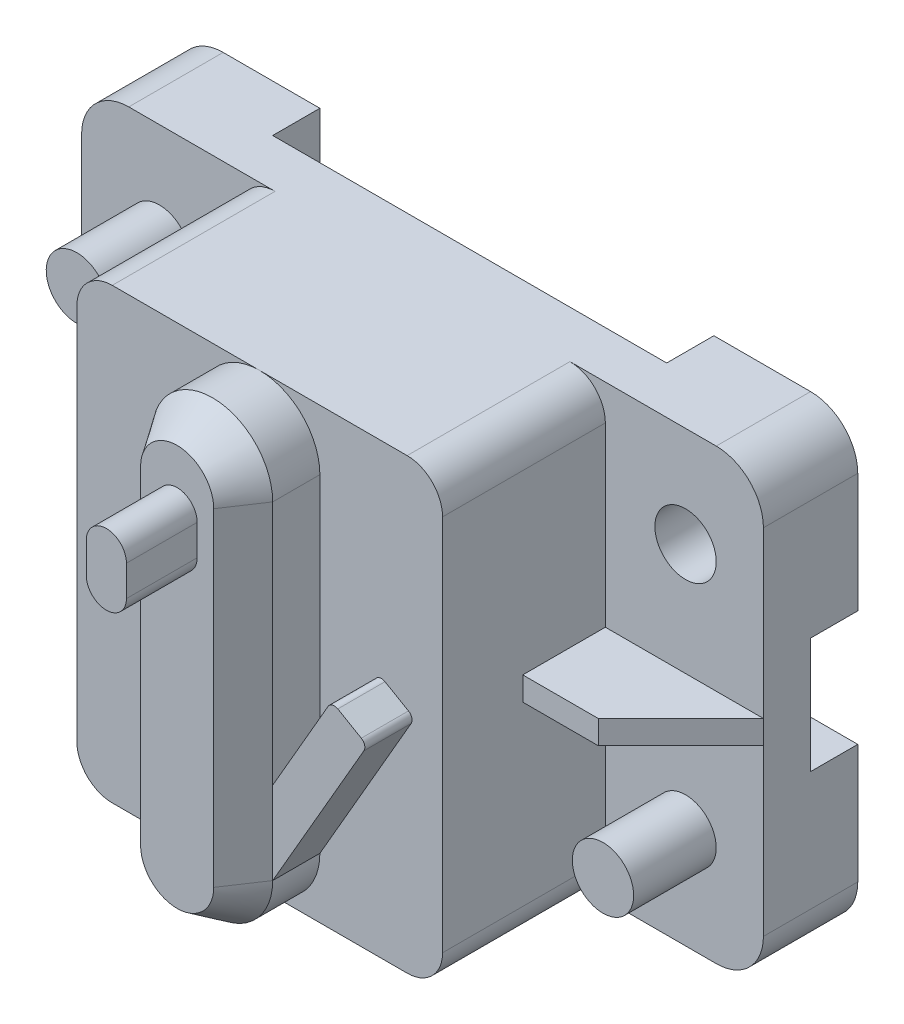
ISO-10303-21;
HEADER;
FILE_DESCRIPTION(('STEP AP214'),'2;1');
FILE_NAME('part.step','',(''),(''),'','','');
FILE_SCHEMA(('AUTOMOTIVE_DESIGN { 1 0 10303 214 1 1 1 1 }'));
ENDSEC;
DATA;
#1=APPLICATION_CONTEXT('core data for automotive mechanical design processes');
#2=APPLICATION_PROTOCOL_DEFINITION('international standard','automotive_design',2000,#1);
#3=PRODUCT_CONTEXT('',#1,'mechanical');
#4=PRODUCT('Part','Part','',(#3));
#5=PRODUCT_RELATED_PRODUCT_CATEGORY('part','',(#4));
#6=PRODUCT_DEFINITION_FORMATION('','',#4);
#7=PRODUCT_DEFINITION_CONTEXT('part definition',#1,'design');
#8=PRODUCT_DEFINITION('design','',#6,#7);
#9=PRODUCT_DEFINITION_SHAPE('','',#8);
#10=(LENGTH_UNIT() NAMED_UNIT(*) SI_UNIT(.MILLI.,.METRE.));
#11=(NAMED_UNIT(*) PLANE_ANGLE_UNIT() SI_UNIT($,.RADIAN.));
#12=(NAMED_UNIT(*) SI_UNIT($,.STERADIAN.) SOLID_ANGLE_UNIT());
#13=UNCERTAINTY_MEASURE_WITH_UNIT(LENGTH_MEASURE(1.E-05),#10,'distance_accuracy_value','');
#14=(GEOMETRIC_REPRESENTATION_CONTEXT(3) GLOBAL_UNCERTAINTY_ASSIGNED_CONTEXT((#13)) GLOBAL_UNIT_ASSIGNED_CONTEXT((#10,
#11,#12)) REPRESENTATION_CONTEXT('',''));
#15=CARTESIAN_POINT('',(0.,0.,0.));
#16=DIRECTION('',(0.,0.,1.));
#17=DIRECTION('',(1.,0.,0.));
#18=AXIS2_PLACEMENT_3D('',#15,#16,#17);
#19=CARTESIAN_POINT('',(0.,-17.653,36.576));
#20=DIRECTION('',(0.,0.,-1.));
#21=DIRECTION('',(0.,1.,0.));
#22=AXIS2_PLACEMENT_3D('',#19,#20,#21);
#23=CONICAL_SURFACE('',#22,3.937,0.588002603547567);
#24=DIRECTION('',(-0.554700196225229,0.,-0.832050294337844));
#25=VECTOR('',#24,1.);
#26=CARTESIAN_POINT('',(-3.937,-17.653,36.576));
#27=LINE('',#26,#25);
#28=CARTESIAN_POINT('',(-3.937,-17.653,36.576));
#29=VERTEX_POINT('',#28);
#30=CARTESIAN_POINT('',(-6.477,-17.653,32.766));
#31=VERTEX_POINT('',#30);
#32=EDGE_CURVE('E20',#29,#31,#27,.T.);
#33=ORIENTED_EDGE('',*,*,#32,.T.);
#34=CARTESIAN_POINT('',(0.,-17.653,32.766));
#35=DIRECTION('',(0.,0.,-1.));
#36=DIRECTION('',(0.,-1.,0.));
#37=AXIS2_PLACEMENT_3D('',#34,#35,#36);
#38=CIRCLE('',#37,6.477);
#39=CARTESIAN_POINT('',(6.477,-17.653,32.766));
#40=VERTEX_POINT('',#39);
#41=EDGE_CURVE('E412',#40,#31,#38,.T.);
#42=ORIENTED_EDGE('',*,*,#41,.F.);
#43=DIRECTION('',(-0.554700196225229,0.,0.832050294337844));
#44=VECTOR('',#43,1.);
#45=CARTESIAN_POINT('',(6.477,-17.653,32.766));
#46=LINE('',#45,#44);
#47=CARTESIAN_POINT('',(3.937,-17.653,36.576));
#48=VERTEX_POINT('',#47);
#49=EDGE_CURVE('E11',#40,#48,#46,.T.);
#50=ORIENTED_EDGE('',*,*,#49,.T.);
#51=CARTESIAN_POINT('',(0.,-17.653,36.576));
#52=DIRECTION('',(0.,0.,1.));
#53=DIRECTION('',(0.,-1.,0.));
#54=AXIS2_PLACEMENT_3D('',#51,#52,#53);
#55=CIRCLE('',#54,3.937);
#56=EDGE_CURVE('E415',#29,#48,#55,.T.);
#57=ORIENTED_EDGE('',*,*,#56,.F.);
#58=EDGE_LOOP('',(#33,#42,#50,#57));
#59=FACE_BOUND('',#58,.T.);
#60=ADVANCED_FACE('F17',(#59),#23,.T.);
#61=CARTESIAN_POINT('',(6.477,-1.64215489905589,32.766));
#62=DIRECTION('',(-0.832050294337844,0.,-0.554700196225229));
#63=DIRECTION('',(-0.554700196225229,0.,0.832050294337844));
#64=AXIS2_PLACEMENT_3D('',#61,#62,#63);
#65=PLANE('',#64);
#66=DIRECTION('',(-0.554700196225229,0.,0.832050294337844));
#67=VECTOR('',#66,1.);
#68=CARTESIAN_POINT('',(6.477,17.6529999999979,32.766));
#69=LINE('',#68,#67);
#70=CARTESIAN_POINT('',(6.477,17.6529999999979,32.766));
#71=VERTEX_POINT('',#70);
#72=CARTESIAN_POINT('',(3.937,17.6529999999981,36.576));
#73=VERTEX_POINT('',#72);
#74=EDGE_CURVE('E395',#71,#73,#69,.T.);
#75=ORIENTED_EDGE('',*,*,#74,.T.);
#76=DIRECTION('',(0.,1.,0.));
#77=VECTOR('',#76,1.);
#78=CARTESIAN_POINT('',(3.937,12.065,36.576));
#79=LINE('',#78,#77);
#80=EDGE_CURVE('E452',#48,#73,#79,.T.);
#81=ORIENTED_EDGE('',*,*,#80,.F.);
#82=ORIENTED_EDGE('',*,*,#49,.F.);
#83=DIRECTION('',(0.,-1.,0.));
#84=VECTOR('',#83,1.);
#85=CARTESIAN_POINT('',(6.477,-1.64215489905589,32.766));
#86=LINE('',#85,#84);
#87=CARTESIAN_POINT('',(6.477,-8.763,32.766));
#88=VERTEX_POINT('',#87);
#89=EDGE_CURVE('E336',#88,#40,#86,.T.);
#90=ORIENTED_EDGE('',*,*,#89,.F.);
#91=DIRECTION('',(0.,-1.,0.));
#92=VECTOR('',#91,1.);
#93=CARTESIAN_POINT('',(6.477,-1.64215489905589,32.766));
#94=LINE('',#93,#92);
#95=EDGE_CURVE('E790',#71,#88,#94,.T.);
#96=ORIENTED_EDGE('',*,*,#95,.F.);
#97=EDGE_LOOP('',(#75,#81,#82,#90,#96));
#98=FACE_BOUND('',#97,.T.);
#99=ADVANCED_FACE('F1228',(#98),#65,.F.);
#100=CARTESIAN_POINT('',(-6.477,-6.00610924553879E-13,32.766));
#101=DIRECTION('',(0.832050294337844,0.,-0.554700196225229));
#102=DIRECTION('',(0.,-1.,0.));
#103=AXIS2_PLACEMENT_3D('',#100,#101,#102);
#104=PLANE('',#103);
#105=DIRECTION('',(-0.554700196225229,0.,-0.832050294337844));
#106=VECTOR('',#105,1.);
#107=CARTESIAN_POINT('',(-3.937,17.6529999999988,36.576));
#108=LINE('',#107,#106);
#109=CARTESIAN_POINT('',(-3.937,17.6529999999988,36.576));
#110=VERTEX_POINT('',#109);
#111=CARTESIAN_POINT('',(-6.477,17.6529999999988,32.766));
#112=VERTEX_POINT('',#111);
#113=EDGE_CURVE('E397',#110,#112,#108,.T.);
#114=ORIENTED_EDGE('',*,*,#113,.T.);
#115=DIRECTION('',(0.,1.,0.));
#116=VECTOR('',#115,1.);
#117=CARTESIAN_POINT('',(-6.477,-6.00610924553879E-13,32.766));
#118=LINE('',#117,#116);
#119=EDGE_CURVE('E428',#31,#112,#118,.T.);
#120=ORIENTED_EDGE('',*,*,#119,.F.);
#121=ORIENTED_EDGE('',*,*,#32,.F.);
#122=DIRECTION('',(0.,-1.,0.));
#123=VECTOR('',#122,1.);
#124=CARTESIAN_POINT('',(-3.937,12.065,36.576));
#125=LINE('',#124,#123);
#126=EDGE_CURVE('E426',#110,#29,#125,.T.);
#127=ORIENTED_EDGE('',*,*,#126,.F.);
#128=EDGE_LOOP('',(#114,#120,#121,#127));
#129=FACE_BOUND('',#128,.T.);
#130=ADVANCED_FACE('F429',(#129),#104,.F.);
#131=CARTESIAN_POINT('',(0.,17.6529999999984,36.576));
#132=DIRECTION('',(0.,0.,-1.));
#133=DIRECTION('',(0.,1.,0.));
#134=AXIS2_PLACEMENT_3D('',#131,#132,#133);
#135=CONICAL_SURFACE('',#134,3.937,0.588002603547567);
#136=ORIENTED_EDGE('',*,*,#74,.F.);
#137=CARTESIAN_POINT('',(0.,17.6529999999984,32.766));
#138=DIRECTION('',(0.,0.,-1.));
#139=DIRECTION('',(0.,-1.,0.));
#140=AXIS2_PLACEMENT_3D('',#137,#138,#139);
#141=CIRCLE('',#140,6.477);
#142=EDGE_CURVE('E439',#112,#71,#141,.T.);
#143=ORIENTED_EDGE('',*,*,#142,.F.);
#144=ORIENTED_EDGE('',*,*,#113,.F.);
#145=CARTESIAN_POINT('',(0.,17.6529999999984,36.576));
#146=DIRECTION('',(0.,0.,1.));
#147=DIRECTION('',(0.,-1.,0.));
#148=AXIS2_PLACEMENT_3D('',#145,#146,#147);
#149=CIRCLE('',#148,3.937);
#150=EDGE_CURVE('E456',#73,#110,#149,.T.);
#151=ORIENTED_EDGE('',*,*,#150,.F.);
#152=EDGE_LOOP('',(#136,#143,#144,#151));
#153=FACE_BOUND('',#152,.T.);
#154=ADVANCED_FACE('F1238',(#153),#135,.T.);
#155=CARTESIAN_POINT('',(-28.321,13.335,19.05));
#156=DIRECTION('',(0.,0.,-1.));
#157=DIRECTION('',(0.,-1.,0.));
#158=AXIS2_PLACEMENT_3D('',#155,#156,#157);
#159=PLANE('',#158);
#160=CARTESIAN_POINT('',(-28.321,13.335,19.05));
#161=DIRECTION('',(0.,0.,-1.));
#162=DIRECTION('',(0.,-1.,0.));
#163=AXIS2_PLACEMENT_3D('',#160,#161,#162);
#164=CIRCLE('',#163,3.302);
#165=CARTESIAN_POINT('',(-28.321,10.033,19.05));
#166=VERTEX_POINT('',#165);
#167=EDGE_CURVE('E37',#166,#166,#164,.T.);
#168=ORIENTED_EDGE('',*,*,#167,.F.);
#169=EDGE_LOOP('',(#168));
#170=FACE_BOUND('',#169,.T.);
#171=ADVANCED_FACE('F1245',(#170),#159,.F.);
#172=CARTESIAN_POINT('',(-28.321,13.335,19.05));
#173=DIRECTION('',(0.,0.,-1.));
#174=DIRECTION('',(0.,1.,0.));
#175=AXIS2_PLACEMENT_3D('',#172,#173,#174);
#176=CYLINDRICAL_SURFACE('',#175,3.302);
#177=ORIENTED_EDGE('',*,*,#167,.T.);
#178=EDGE_LOOP('',(#177));
#179=FACE_BOUND('',#178,.T.);
#180=CARTESIAN_POINT('',(-28.321,13.335,10.16));
#181=DIRECTION('',(0.,0.,1.));
#182=DIRECTION('',(0.,-1.,0.));
#183=AXIS2_PLACEMENT_3D('',#180,#181,#182);
#184=CIRCLE('',#183,3.302);
#185=CARTESIAN_POINT('',(-28.321,10.033,10.16));
#186=VERTEX_POINT('',#185);
#187=EDGE_CURVE('E1156',#186,#186,#184,.T.);
#188=ORIENTED_EDGE('',*,*,#187,.T.);
#189=EDGE_LOOP('',(#188));
#190=FACE_BOUND('',#189,.T.);
#191=ADVANCED_FACE('F1241',(#179,#190),#176,.T.);
#192=CARTESIAN_POINT('',(28.321,-13.335,19.05));
#193=DIRECTION('',(0.,0.,-1.));
#194=DIRECTION('',(0.,-1.,0.));
#195=AXIS2_PLACEMENT_3D('',#192,#193,#194);
#196=PLANE('',#195);
#197=CARTESIAN_POINT('',(28.321,-13.335,19.05));
#198=DIRECTION('',(0.,0.,-1.));
#199=DIRECTION('',(0.,1.,0.));
#200=AXIS2_PLACEMENT_3D('',#197,#198,#199);
#201=CIRCLE('',#200,3.302);
#202=CARTESIAN_POINT('',(28.321,-10.033,19.05));
#203=VERTEX_POINT('',#202);
#204=EDGE_CURVE('E390',#203,#203,#201,.T.);
#205=ORIENTED_EDGE('',*,*,#204,.F.);
#206=EDGE_LOOP('',(#205));
#207=FACE_BOUND('',#206,.T.);
#208=ADVANCED_FACE('F1244',(#207),#196,.F.);
#209=CARTESIAN_POINT('',(28.321,-13.335,19.05));
#210=DIRECTION('',(0.,0.,-1.));
#211=DIRECTION('',(0.,1.,0.));
#212=AXIS2_PLACEMENT_3D('',#209,#210,#211);
#213=CYLINDRICAL_SURFACE('',#212,3.302);
#214=ORIENTED_EDGE('',*,*,#204,.T.);
#215=EDGE_LOOP('',(#214));
#216=FACE_BOUND('',#215,.T.);
#217=CARTESIAN_POINT('',(28.321,-13.335,10.16));
#218=DIRECTION('',(0.,0.,1.));
#219=DIRECTION('',(0.,-1.,0.));
#220=AXIS2_PLACEMENT_3D('',#217,#218,#219);
#221=CIRCLE('',#220,3.302);
#222=CARTESIAN_POINT('',(28.321,-16.637,10.16));
#223=VERTEX_POINT('',#222);
#224=EDGE_CURVE('E573',#223,#223,#221,.T.);
#225=ORIENTED_EDGE('',*,*,#224,.T.);
#226=EDGE_LOOP('',(#225));
#227=FACE_BOUND('',#226,.T.);
#228=ADVANCED_FACE('F1327',(#216,#227),#213,.T.);
#229=CARTESIAN_POINT('',(36.703,-1.27,10.16));
#230=DIRECTION('',(0.,-1.,0.));
#231=DIRECTION('',(0.,0.,-1.));
#232=AXIS2_PLACEMENT_3D('',#229,#230,#231);
#233=PLANE('',#232);
#234=DIRECTION('',(-1.,0.,0.));
#235=VECTOR('',#234,1.);
#236=CARTESIAN_POINT('',(-28.5114987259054,-1.27,10.16));
#237=LINE('',#236,#235);
#238=CARTESIAN_POINT('',(-19.685,-1.27,10.16));
#239=VERTEX_POINT('',#238);
#240=CARTESIAN_POINT('',(-36.7029974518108,-1.27,10.16));
#241=VERTEX_POINT('',#240);
#242=EDGE_CURVE('E969',#239,#241,#237,.T.);
#243=ORIENTED_EDGE('',*,*,#242,.F.);
#244=DIRECTION('',(0.,0.,1.));
#245=VECTOR('',#244,1.);
#246=CARTESIAN_POINT('',(-19.685,-1.27,27.688));
#247=LINE('',#246,#245);
#248=CARTESIAN_POINT('',(-19.685,-1.27,19.0500000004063));
#249=VERTEX_POINT('',#248);
#250=EDGE_CURVE('E1004',#239,#249,#247,.T.);
#251=ORIENTED_EDGE('',*,*,#250,.T.);
#252=DIRECTION('',(-1.,0.,6.39789076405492E-10));
#253=VECTOR('',#252,1.);
#254=CARTESIAN_POINT('',(-24.066500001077,-1.27,19.0500000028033));
#255=LINE('',#254,#253);
#256=CARTESIAN_POINT('',(-27.8130000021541,-1.27,19.0500000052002));
#257=VERTEX_POINT('',#256);
#258=EDGE_CURVE('E384',#249,#257,#255,.T.);
#259=ORIENTED_EDGE('',*,*,#258,.T.);
#260=DIRECTION('',(-0.707106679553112,0.,-0.707106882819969));
#261=VECTOR('',#260,1.);
#262=CARTESIAN_POINT('',(-31.9849345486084,-1.27,14.87806425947));
#263=LINE('',#262,#261);
#264=EDGE_CURVE('E375',#257,#241,#263,.T.);
#265=ORIENTED_EDGE('',*,*,#264,.T.);
#266=EDGE_LOOP('',(#243,#251,#259,#265));
#267=FACE_BOUND('',#266,.T.);
#268=ADVANCED_FACE('F1250',(#267),#233,.T.);
#269=CARTESIAN_POINT('',(-28.1939987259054,1.27,14.6050000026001));
#270=DIRECTION('',(0.,1.,0.));
#271=DIRECTION('',(1.,0.,0.));
#272=AXIS2_PLACEMENT_3D('',#269,#270,#271);
#273=PLANE('',#272);
#274=DIRECTION('',(-1.,0.,0.));
#275=VECTOR('',#274,1.);
#276=CARTESIAN_POINT('',(-28.5114987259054,1.27,10.16));
#277=LINE('',#276,#275);
#278=CARTESIAN_POINT('',(-19.685,1.27,10.16));
#279=VERTEX_POINT('',#278);
#280=CARTESIAN_POINT('',(-36.7029974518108,1.27,10.16));
#281=VERTEX_POINT('',#280);
#282=EDGE_CURVE('E1144',#279,#281,#277,.T.);
#283=ORIENTED_EDGE('',*,*,#282,.T.);
#284=DIRECTION('',(-0.707106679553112,0.,-0.707106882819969));
#285=VECTOR('',#284,1.);
#286=CARTESIAN_POINT('',(-31.9849345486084,1.27,14.87806425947));
#287=LINE('',#286,#285);
#288=CARTESIAN_POINT('',(-27.8130000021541,1.27,19.0500000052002));
#289=VERTEX_POINT('',#288);
#290=EDGE_CURVE('E380',#289,#281,#287,.T.);
#291=ORIENTED_EDGE('',*,*,#290,.F.);
#292=DIRECTION('',(-1.,0.,6.39789076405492E-10));
#293=VECTOR('',#292,1.);
#294=CARTESIAN_POINT('',(-24.066500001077,1.27,19.0500000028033));
#295=LINE('',#294,#293);
#296=CARTESIAN_POINT('',(-19.685,1.27,19.0500000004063));
#297=VERTEX_POINT('',#296);
#298=EDGE_CURVE('E387',#297,#289,#295,.T.);
#299=ORIENTED_EDGE('',*,*,#298,.F.);
#300=DIRECTION('',(0.,0.,1.));
#301=VECTOR('',#300,1.);
#302=CARTESIAN_POINT('',(-19.685,1.27,27.688));
#303=LINE('',#302,#301);
#304=EDGE_CURVE('E1099',#279,#297,#303,.T.);
#305=ORIENTED_EDGE('',*,*,#304,.F.);
#306=EDGE_LOOP('',(#283,#291,#299,#305));
#307=FACE_BOUND('',#306,.T.);
#308=ADVANCED_FACE('F1246',(#307),#273,.T.);
#309=CARTESIAN_POINT('',(-24.066500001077,-1.272,19.0500000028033));
#310=DIRECTION('',(-6.39789076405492E-10,0.,-1.));
#311=DIRECTION('',(-1.,0.,6.39789076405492E-10));
#312=AXIS2_PLACEMENT_3D('',#309,#310,#311);
#313=PLANE('',#312);
#314=ORIENTED_EDGE('',*,*,#258,.F.);
#315=DIRECTION('',(0.,1.,0.));
#316=VECTOR('',#315,1.);
#317=CARTESIAN_POINT('',(-19.685,0.,19.0500000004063));
#318=LINE('',#317,#316);
#319=EDGE_CURVE('E975',#249,#297,#318,.T.);
#320=ORIENTED_EDGE('',*,*,#319,.T.);
#321=ORIENTED_EDGE('',*,*,#298,.T.);
#322=DIRECTION('',(0.,1.,0.));
#323=VECTOR('',#322,1.);
#324=CARTESIAN_POINT('',(-27.8130000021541,-1.272,19.0500000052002));
#325=LINE('',#324,#323);
#326=EDGE_CURVE('E376',#257,#289,#325,.T.);
#327=ORIENTED_EDGE('',*,*,#326,.F.);
#328=EDGE_LOOP('',(#314,#320,#321,#327));
#329=FACE_BOUND('',#328,.T.);
#330=ADVANCED_FACE('F1249',(#329),#313,.F.);
#331=CARTESIAN_POINT('',(-31.9849345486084,-1.272,14.87806425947));
#332=DIRECTION('',(0.707106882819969,0.,-0.707106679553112));
#333=DIRECTION('',(0.,-1.,0.));
#334=AXIS2_PLACEMENT_3D('',#331,#332,#333);
#335=PLANE('',#334);
#336=ORIENTED_EDGE('',*,*,#264,.F.);
#337=ORIENTED_EDGE('',*,*,#326,.T.);
#338=ORIENTED_EDGE('',*,*,#290,.T.);
#339=DIRECTION('',(0.,1.,0.));
#340=VECTOR('',#339,1.);
#341=CARTESIAN_POINT('',(-36.7029974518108,-1.272,10.16));
#342=LINE('',#341,#340);
#343=EDGE_CURVE('E658',#241,#281,#342,.T.);
#344=ORIENTED_EDGE('',*,*,#343,.F.);
#345=EDGE_LOOP('',(#336,#337,#338,#344));
#346=FACE_BOUND('',#345,.T.);
#347=ADVANCED_FACE('F1255',(#346),#335,.F.);
#348=CARTESIAN_POINT('',(36.703,-1.27,10.16));
#349=DIRECTION('',(0.,-1.,0.));
#350=DIRECTION('',(0.,0.,-1.));
#351=AXIS2_PLACEMENT_3D('',#348,#349,#350);
#352=PLANE('',#351);
#353=DIRECTION('',(1.,0.,6.39789076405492E-10));
#354=VECTOR('',#353,1.);
#355=CARTESIAN_POINT('',(24.066500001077,-1.27,19.0500000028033));
#356=LINE('',#355,#354);
#357=CARTESIAN_POINT('',(19.685,-1.27,19.0500000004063));
#358=VERTEX_POINT('',#357);
#359=CARTESIAN_POINT('',(27.8130000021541,-1.27,19.0500000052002));
#360=VERTEX_POINT('',#359);
#361=EDGE_CURVE('E365',#358,#360,#356,.T.);
#362=ORIENTED_EDGE('',*,*,#361,.F.);
#363=DIRECTION('',(0.,0.,1.));
#364=VECTOR('',#363,1.);
#365=CARTESIAN_POINT('',(19.685,-1.27,27.688));
#366=LINE('',#365,#364);
#367=CARTESIAN_POINT('',(19.685,-1.27,10.16));
#368=VERTEX_POINT('',#367);
#369=EDGE_CURVE('E1027',#368,#358,#366,.T.);
#370=ORIENTED_EDGE('',*,*,#369,.F.);
#371=DIRECTION('',(1.,0.,0.));
#372=VECTOR('',#371,1.);
#373=CARTESIAN_POINT('',(28.5114987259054,-1.27,10.16));
#374=LINE('',#373,#372);
#375=CARTESIAN_POINT('',(36.703,-1.27,10.16));
#376=VERTEX_POINT('',#375);
#377=EDGE_CURVE('E519',#368,#376,#374,.T.);
#378=ORIENTED_EDGE('',*,*,#377,.T.);
#379=DIRECTION('',(0.707106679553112,0.,-0.707106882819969));
#380=VECTOR('',#379,1.);
#381=CARTESIAN_POINT('',(31.9849345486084,-1.27,14.87806425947));
#382=LINE('',#381,#380);
#383=EDGE_CURVE('E372',#360,#376,#382,.T.);
#384=ORIENTED_EDGE('',*,*,#383,.F.);
#385=EDGE_LOOP('',(#362,#370,#378,#384));
#386=FACE_BOUND('',#385,.T.);
#387=ADVANCED_FACE('F1251',(#386),#352,.T.);
#388=CARTESIAN_POINT('',(31.9849345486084,-1.272,14.87806425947));
#389=DIRECTION('',(0.707106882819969,0.,0.707106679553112));
#390=DIRECTION('',(0.,-1.,0.));
#391=AXIS2_PLACEMENT_3D('',#388,#389,#390);
#392=PLANE('',#391);
#393=DIRECTION('',(0.,1.,0.));
#394=VECTOR('',#393,1.);
#395=CARTESIAN_POINT('',(27.8130000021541,-1.272,19.0500000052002));
#396=LINE('',#395,#394);
#397=CARTESIAN_POINT('',(27.8130000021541,1.27,19.0500000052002));
#398=VERTEX_POINT('',#397);
#399=EDGE_CURVE('E369',#360,#398,#396,.T.);
#400=ORIENTED_EDGE('',*,*,#399,.F.);
#401=ORIENTED_EDGE('',*,*,#383,.T.);
#402=DIRECTION('',(0.,1.,0.));
#403=VECTOR('',#402,1.);
#404=CARTESIAN_POINT('',(36.7029974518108,-1.272,10.16));
#405=LINE('',#404,#403);
#406=CARTESIAN_POINT('',(36.703,1.27,10.16));
#407=VERTEX_POINT('',#406);
#408=EDGE_CURVE('E715',#376,#407,#405,.T.);
#409=ORIENTED_EDGE('',*,*,#408,.T.);
#410=DIRECTION('',(0.707106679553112,0.,-0.707106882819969));
#411=VECTOR('',#410,1.);
#412=CARTESIAN_POINT('',(31.9849345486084,1.27,14.87806425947));
#413=LINE('',#412,#411);
#414=EDGE_CURVE('E364',#398,#407,#413,.T.);
#415=ORIENTED_EDGE('',*,*,#414,.F.);
#416=EDGE_LOOP('',(#400,#401,#409,#415));
#417=FACE_BOUND('',#416,.T.);
#418=ADVANCED_FACE('F1254',(#417),#392,.T.);
#419=CARTESIAN_POINT('',(24.066500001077,-1.272,19.0500000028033));
#420=DIRECTION('',(-6.39789076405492E-10,0.,1.));
#421=DIRECTION('',(0.,1.,0.));
#422=AXIS2_PLACEMENT_3D('',#419,#420,#421);
#423=PLANE('',#422);
#424=DIRECTION('',(1.,0.,6.39789076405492E-10));
#425=VECTOR('',#424,1.);
#426=CARTESIAN_POINT('',(24.066500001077,1.27,19.0500000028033));
#427=LINE('',#426,#425);
#428=CARTESIAN_POINT('',(19.685,1.27,19.0500000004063));
#429=VERTEX_POINT('',#428);
#430=EDGE_CURVE('E360',#429,#398,#427,.T.);
#431=ORIENTED_EDGE('',*,*,#430,.F.);
#432=DIRECTION('',(0.,1.,0.));
#433=VECTOR('',#432,1.);
#434=CARTESIAN_POINT('',(19.685,0.,19.0500000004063));
#435=LINE('',#434,#433);
#436=EDGE_CURVE('E1031',#358,#429,#435,.T.);
#437=ORIENTED_EDGE('',*,*,#436,.F.);
#438=ORIENTED_EDGE('',*,*,#361,.T.);
#439=ORIENTED_EDGE('',*,*,#399,.T.);
#440=EDGE_LOOP('',(#431,#437,#438,#439));
#441=FACE_BOUND('',#440,.T.);
#442=ADVANCED_FACE('F1260',(#441),#423,.T.);
#443=CARTESIAN_POINT('',(28.1939987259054,1.27,14.6050000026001));
#444=DIRECTION('',(0.,1.,0.));
#445=DIRECTION('',(1.,0.,0.));
#446=AXIS2_PLACEMENT_3D('',#443,#444,#445);
#447=PLANE('',#446);
#448=DIRECTION('',(1.,0.,0.));
#449=VECTOR('',#448,1.);
#450=CARTESIAN_POINT('',(28.5114987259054,1.27,10.16));
#451=LINE('',#450,#449);
#452=CARTESIAN_POINT('',(19.685,1.27,10.16));
#453=VERTEX_POINT('',#452);
#454=EDGE_CURVE('E1016',#453,#407,#451,.T.);
#455=ORIENTED_EDGE('',*,*,#454,.F.);
#456=DIRECTION('',(0.,0.,1.));
#457=VECTOR('',#456,1.);
#458=CARTESIAN_POINT('',(19.685,1.27,27.688));
#459=LINE('',#458,#457);
#460=EDGE_CURVE('E1071',#453,#429,#459,.T.);
#461=ORIENTED_EDGE('',*,*,#460,.T.);
#462=ORIENTED_EDGE('',*,*,#430,.T.);
#463=ORIENTED_EDGE('',*,*,#414,.T.);
#464=EDGE_LOOP('',(#455,#461,#462,#463));
#465=FACE_BOUND('',#464,.T.);
#466=ADVANCED_FACE('F1263',(#465),#447,.T.);
#467=CARTESIAN_POINT('',(9.8425,0.,32.766));
#468=DIRECTION('',(0.,0.,1.));
#469=DIRECTION('',(1.,0.,0.));
#470=AXIS2_PLACEMENT_3D('',#467,#468,#469);
#471=PLANE('',#470);
#472=CARTESIAN_POINT('',(13.1059113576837,1.19461127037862,32.766));
#473=DIRECTION('',(0.,0.,1.));
#474=DIRECTION('',(0.,1.,0.));
#475=AXIS2_PLACEMENT_3D('',#472,#473,#474);
#476=CIRCLE('',#475,0.762);
#477=CARTESIAN_POINT('',(13.4869113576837,1.85452262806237,32.766));
#478=VERTEX_POINT('',#477);
#479=CARTESIAN_POINT('',(12.446,1.57561127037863,32.766));
#480=VERTEX_POINT('',#479);
#481=EDGE_CURVE('E501',#478,#480,#476,.T.);
#482=ORIENTED_EDGE('',*,*,#481,.T.);
#483=DIRECTION('',(-0.5,-0.866025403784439,0.));
#484=VECTOR('',#483,1.);
#485=CARTESIAN_POINT('',(9.4615,-3.59369436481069,32.766));
#486=LINE('',#485,#484);
#487=EDGE_CURVE('E504',#480,#88,#486,.T.);
#488=ORIENTED_EDGE('',*,*,#487,.T.);
#489=ORIENTED_EDGE('',*,*,#89,.T.);
#490=DIRECTION('',(0.5,0.866025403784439,0.));
#491=VECTOR('',#490,1.);
#492=CARTESIAN_POINT('',(11.3862414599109,-9.14994436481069,32.766));
#493=LINE('',#492,#491);
#494=CARTESIAN_POINT('',(16.2954829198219,-0.646888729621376,32.766));
#495=VERTEX_POINT('',#494);
#496=EDGE_CURVE('E343',#40,#495,#493,.T.);
#497=ORIENTED_EDGE('',*,*,#496,.T.);
#498=CARTESIAN_POINT('',(15.6355715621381,-0.265888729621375,32.766));
#499=DIRECTION('',(0.,0.,1.));
#500=DIRECTION('',(0.,1.,0.));
#501=AXIS2_PLACEMENT_3D('',#498,#499,#500);
#502=CIRCLE('',#501,0.762);
#503=CARTESIAN_POINT('',(16.0165715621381,0.394022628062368,32.766));
#504=VERTEX_POINT('',#503);
#505=EDGE_CURVE('E337',#495,#504,#502,.T.);
#506=ORIENTED_EDGE('',*,*,#505,.T.);
#507=DIRECTION('',(0.866025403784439,-0.5,0.));
#508=VECTOR('',#507,1.);
#509=CARTESIAN_POINT('',(14.7517414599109,1.12427262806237,32.766));
#510=LINE('',#509,#508);
#511=EDGE_CURVE('E324',#478,#504,#510,.T.);
#512=ORIENTED_EDGE('',*,*,#511,.F.);
#513=EDGE_LOOP('',(#482,#488,#489,#497,#506,#512));
#514=FACE_BOUND('',#513,.T.);
#515=ADVANCED_FACE('F340',(#514),#471,.T.);
#516=CARTESIAN_POINT('',(14.7517414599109,1.12427262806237,32.766));
#517=DIRECTION('',(0.5,0.866025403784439,0.));
#518=DIRECTION('',(0.,0.,-1.));
#519=AXIS2_PLACEMENT_3D('',#516,#517,#518);
#520=PLANE('',#519);
#521=DIRECTION('',(0.866025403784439,-0.5,0.));
#522=VECTOR('',#521,1.);
#523=CARTESIAN_POINT('',(14.7517414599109,1.12427262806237,27.686));
#524=LINE('',#523,#522);
#525=CARTESIAN_POINT('',(13.4869113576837,1.85452262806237,27.686));
#526=VERTEX_POINT('',#525);
#527=CARTESIAN_POINT('',(16.0165715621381,0.394022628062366,27.686));
#528=VERTEX_POINT('',#527);
#529=EDGE_CURVE('E517',#526,#528,#524,.T.);
#530=ORIENTED_EDGE('',*,*,#529,.F.);
#531=DIRECTION('',(0.,0.,-1.));
#532=VECTOR('',#531,1.);
#533=CARTESIAN_POINT('',(13.4869113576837,1.85452262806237,32.766));
#534=LINE('',#533,#532);
#535=EDGE_CURVE('E331',#478,#526,#534,.T.);
#536=ORIENTED_EDGE('',*,*,#535,.F.);
#537=ORIENTED_EDGE('',*,*,#511,.T.);
#538=DIRECTION('',(0.,0.,-1.));
#539=VECTOR('',#538,1.);
#540=CARTESIAN_POINT('',(16.0165715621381,0.394022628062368,32.766));
#541=LINE('',#540,#539);
#542=EDGE_CURVE('E329',#504,#528,#541,.T.);
#543=ORIENTED_EDGE('',*,*,#542,.T.);
#544=EDGE_LOOP('',(#530,#536,#537,#543));
#545=FACE_BOUND('',#544,.T.);
#546=ADVANCED_FACE('F327',(#545),#520,.T.);
#547=CARTESIAN_POINT('',(15.6355715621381,-0.265888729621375,32.766));
#548=DIRECTION('',(0.,0.,-1.));
#549=DIRECTION('',(0.,-1.,0.));
#550=AXIS2_PLACEMENT_3D('',#547,#548,#549);
#551=CYLINDRICAL_SURFACE('',#550,0.762);
#552=CARTESIAN_POINT('',(15.6355715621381,-0.265888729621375,27.686));
#553=DIRECTION('',(0.,0.,1.));
#554=DIRECTION('',(0.,1.,0.));
#555=AXIS2_PLACEMENT_3D('',#552,#553,#554);
#556=CIRCLE('',#555,0.762);
#557=CARTESIAN_POINT('',(16.2954829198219,-0.646888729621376,27.686));
#558=VERTEX_POINT('',#557);
#559=EDGE_CURVE('E350',#558,#528,#556,.T.);
#560=ORIENTED_EDGE('',*,*,#559,.T.);
#561=ORIENTED_EDGE('',*,*,#542,.F.);
#562=ORIENTED_EDGE('',*,*,#505,.F.);
#563=DIRECTION('',(0.,0.,-1.));
#564=VECTOR('',#563,1.);
#565=CARTESIAN_POINT('',(16.2954829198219,-0.646888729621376,32.766));
#566=LINE('',#565,#564);
#567=EDGE_CURVE('E356',#495,#558,#566,.T.);
#568=ORIENTED_EDGE('',*,*,#567,.T.);
#569=EDGE_LOOP('',(#560,#561,#562,#568));
#570=FACE_BOUND('',#569,.T.);
#571=ADVANCED_FACE('F348',(#570),#551,.T.);
#572=CARTESIAN_POINT('',(11.3862414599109,-9.14994436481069,32.766));
#573=DIRECTION('',(-0.866025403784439,0.5,0.));
#574=DIRECTION('',(0.,0.,1.));
#575=AXIS2_PLACEMENT_3D('',#572,#573,#574);
#576=PLANE('',#575);
#577=DIRECTION('',(0.5,0.866025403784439,0.));
#578=VECTOR('',#577,1.);
#579=CARTESIAN_POINT('',(11.3862414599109,-9.14994436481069,27.686));
#580=LINE('',#579,#578);
#581=CARTESIAN_POINT('',(6.477,-17.653,27.686));
#582=VERTEX_POINT('',#581);
#583=EDGE_CURVE('E515',#582,#558,#580,.T.);
#584=ORIENTED_EDGE('',*,*,#583,.T.);
#585=ORIENTED_EDGE('',*,*,#567,.F.);
#586=ORIENTED_EDGE('',*,*,#496,.F.);
#587=DIRECTION('',(0.,0.,-1.));
#588=VECTOR('',#587,1.);
#589=CARTESIAN_POINT('',(6.477,-17.653,32.766));
#590=LINE('',#589,#588);
#591=EDGE_CURVE('E424',#40,#582,#590,.T.);
#592=ORIENTED_EDGE('',*,*,#591,.T.);
#593=EDGE_LOOP('',(#584,#585,#586,#592));
#594=FACE_BOUND('',#593,.T.);
#595=ADVANCED_FACE('F521',(#594),#576,.F.);
#596=CARTESIAN_POINT('',(9.4615,-3.59369436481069,32.766));
#597=DIRECTION('',(0.866025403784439,-0.5,0.));
#598=DIRECTION('',(0.,0.,-1.));
#599=AXIS2_PLACEMENT_3D('',#596,#597,#598);
#600=PLANE('',#599);
#601=DIRECTION('',(-0.5,-0.866025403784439,0.));
#602=VECTOR('',#601,1.);
#603=CARTESIAN_POINT('',(9.4615,-3.59369436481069,27.686));
#604=LINE('',#603,#602);
#605=CARTESIAN_POINT('',(12.446,1.57561127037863,27.686));
#606=VERTEX_POINT('',#605);
#607=CARTESIAN_POINT('',(6.477,-8.763,27.686));
#608=VERTEX_POINT('',#607);
#609=EDGE_CURVE('E578',#606,#608,#604,.T.);
#610=ORIENTED_EDGE('',*,*,#609,.T.);
#611=DIRECTION('',(0.,0.,-1.));
#612=VECTOR('',#611,1.);
#613=CARTESIAN_POINT('',(6.477,-8.763,32.766));
#614=LINE('',#613,#612);
#615=EDGE_CURVE('E793',#88,#608,#614,.T.);
#616=ORIENTED_EDGE('',*,*,#615,.F.);
#617=ORIENTED_EDGE('',*,*,#487,.F.);
#618=DIRECTION('',(0.,0.,-1.));
#619=VECTOR('',#618,1.);
#620=CARTESIAN_POINT('',(12.446,1.57561127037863,32.766));
#621=LINE('',#620,#619);
#622=EDGE_CURVE('E498',#480,#606,#621,.T.);
#623=ORIENTED_EDGE('',*,*,#622,.T.);
#624=EDGE_LOOP('',(#610,#616,#617,#623));
#625=FACE_BOUND('',#624,.T.);
#626=ADVANCED_FACE('F1271',(#625),#600,.F.);
#627=CARTESIAN_POINT('',(13.1059113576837,1.19461127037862,32.766));
#628=DIRECTION('',(0.,0.,-1.));
#629=DIRECTION('',(0.,-1.,0.));
#630=AXIS2_PLACEMENT_3D('',#627,#628,#629);
#631=CYLINDRICAL_SURFACE('',#630,0.762);
#632=CARTESIAN_POINT('',(13.1059113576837,1.19461127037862,27.686));
#633=DIRECTION('',(0.,0.,1.));
#634=DIRECTION('',(0.,1.,0.));
#635=AXIS2_PLACEMENT_3D('',#632,#633,#634);
#636=CIRCLE('',#635,0.762);
#637=EDGE_CURVE('E587',#526,#606,#636,.T.);
#638=ORIENTED_EDGE('',*,*,#637,.T.);
#639=ORIENTED_EDGE('',*,*,#622,.F.);
#640=ORIENTED_EDGE('',*,*,#481,.F.);
#641=ORIENTED_EDGE('',*,*,#535,.T.);
#642=EDGE_LOOP('',(#638,#639,#640,#641));
#643=FACE_BOUND('',#642,.T.);
#644=ADVANCED_FACE('F1267',(#643),#631,.T.);
#645=CARTESIAN_POINT('',(0.,13.843,44.196));
#646=DIRECTION('',(0.,0.,1.));
#647=DIRECTION('',(1.,0.,0.));
#648=AXIS2_PLACEMENT_3D('',#645,#646,#647);
#649=PLANE('',#648);
#650=CARTESIAN_POINT('',(0.,12.192,44.196));
#651=DIRECTION('',(0.,0.,1.));
#652=DIRECTION('',(0.,1.,0.));
#653=AXIS2_PLACEMENT_3D('',#650,#651,#652);
#654=CIRCLE('',#653,2.159);
#655=CARTESIAN_POINT('',(-2.159,12.192,44.196));
#656=VERTEX_POINT('',#655);
#657=CARTESIAN_POINT('',(2.159,12.192,44.196));
#658=VERTEX_POINT('',#657);
#659=EDGE_CURVE('E495',#656,#658,#654,.T.);
#660=ORIENTED_EDGE('',*,*,#659,.T.);
#661=DIRECTION('',(0.,1.,0.));
#662=VECTOR('',#661,1.);
#663=CARTESIAN_POINT('',(2.159,13.843,44.196));
#664=LINE('',#663,#662);
#665=CARTESIAN_POINT('',(2.159,15.494,44.196));
#666=VERTEX_POINT('',#665);
#667=EDGE_CURVE('E473',#658,#666,#664,.T.);
#668=ORIENTED_EDGE('',*,*,#667,.T.);
#669=CARTESIAN_POINT('',(0.,15.494,44.196));
#670=DIRECTION('',(0.,0.,1.));
#671=DIRECTION('',(0.,1.,0.));
#672=AXIS2_PLACEMENT_3D('',#669,#670,#671);
#673=CIRCLE('',#672,2.159);
#674=CARTESIAN_POINT('',(-2.159,15.494,44.196));
#675=VERTEX_POINT('',#674);
#676=EDGE_CURVE('E483',#666,#675,#673,.T.);
#677=ORIENTED_EDGE('',*,*,#676,.T.);
#678=DIRECTION('',(0.,-1.,0.));
#679=VECTOR('',#678,1.);
#680=CARTESIAN_POINT('',(-2.159,13.843,44.196));
#681=LINE('',#680,#679);
#682=EDGE_CURVE('E490',#675,#656,#681,.T.);
#683=ORIENTED_EDGE('',*,*,#682,.T.);
#684=EDGE_LOOP('',(#660,#668,#677,#683));
#685=FACE_BOUND('',#684,.T.);
#686=ADVANCED_FACE('F1270',(#685),#649,.T.);
#687=CARTESIAN_POINT('',(0.,12.192,44.198));
#688=DIRECTION('',(0.,0.,-1.));
#689=DIRECTION('',(0.,-1.,0.));
#690=AXIS2_PLACEMENT_3D('',#687,#688,#689);
#691=CYLINDRICAL_SURFACE('',#690,2.159);
#692=ORIENTED_EDGE('',*,*,#659,.F.);
#693=DIRECTION('',(0.,0.,-1.));
#694=VECTOR('',#693,1.);
#695=CARTESIAN_POINT('',(-2.159,12.192,44.198));
#696=LINE('',#695,#694);
#697=CARTESIAN_POINT('',(-2.159,12.192,36.576));
#698=VERTEX_POINT('',#697);
#699=EDGE_CURVE('E494',#656,#698,#696,.T.);
#700=ORIENTED_EDGE('',*,*,#699,.T.);
#701=CARTESIAN_POINT('',(0.,12.192,36.576));
#702=DIRECTION('',(0.,0.,1.));
#703=DIRECTION('',(0.,1.,0.));
#704=AXIS2_PLACEMENT_3D('',#701,#702,#703);
#705=CIRCLE('',#704,2.159);
#706=CARTESIAN_POINT('',(2.159,12.192,36.576));
#707=VERTEX_POINT('',#706);
#708=EDGE_CURVE('E461',#698,#707,#705,.T.);
#709=ORIENTED_EDGE('',*,*,#708,.T.);
#710=DIRECTION('',(0.,0.,-1.));
#711=VECTOR('',#710,1.);
#712=CARTESIAN_POINT('',(2.159,12.192,44.198));
#713=LINE('',#712,#711);
#714=EDGE_CURVE('E477',#658,#707,#713,.T.);
#715=ORIENTED_EDGE('',*,*,#714,.F.);
#716=EDGE_LOOP('',(#692,#700,#709,#715));
#717=FACE_BOUND('',#716,.T.);
#718=ADVANCED_FACE('F1275',(#717),#691,.T.);
#719=CARTESIAN_POINT('',(-2.159,13.843,44.198));
#720=DIRECTION('',(1.,0.,0.));
#721=DIRECTION('',(0.,1.,0.));
#722=AXIS2_PLACEMENT_3D('',#719,#720,#721);
#723=PLANE('',#722);
#724=ORIENTED_EDGE('',*,*,#682,.F.);
#725=DIRECTION('',(0.,0.,-1.));
#726=VECTOR('',#725,1.);
#727=CARTESIAN_POINT('',(-2.159,15.494,44.198));
#728=LINE('',#727,#726);
#729=CARTESIAN_POINT('',(-2.159,15.494,36.576));
#730=VERTEX_POINT('',#729);
#731=EDGE_CURVE('E487',#675,#730,#728,.T.);
#732=ORIENTED_EDGE('',*,*,#731,.T.);
#733=DIRECTION('',(0.,-1.,0.));
#734=VECTOR('',#733,1.);
#735=CARTESIAN_POINT('',(-2.159,13.843,36.576));
#736=LINE('',#735,#734);
#737=EDGE_CURVE('E465',#730,#698,#736,.T.);
#738=ORIENTED_EDGE('',*,*,#737,.T.);
#739=ORIENTED_EDGE('',*,*,#699,.F.);
#740=EDGE_LOOP('',(#724,#732,#738,#739));
#741=FACE_BOUND('',#740,.T.);
#742=ADVANCED_FACE('F1279',(#741),#723,.F.);
#743=CARTESIAN_POINT('',(0.,15.494,44.198));
#744=DIRECTION('',(0.,0.,-1.));
#745=DIRECTION('',(0.,-1.,0.));
#746=AXIS2_PLACEMENT_3D('',#743,#744,#745);
#747=CYLINDRICAL_SURFACE('',#746,2.159);
#748=ORIENTED_EDGE('',*,*,#676,.F.);
#749=DIRECTION('',(0.,0.,-1.));
#750=VECTOR('',#749,1.);
#751=CARTESIAN_POINT('',(2.159,15.494,44.198));
#752=LINE('',#751,#750);
#753=CARTESIAN_POINT('',(2.159,15.494,36.576));
#754=VERTEX_POINT('',#753);
#755=EDGE_CURVE('E480',#666,#754,#752,.T.);
#756=ORIENTED_EDGE('',*,*,#755,.T.);
#757=CARTESIAN_POINT('',(0.,15.494,36.576));
#758=DIRECTION('',(0.,0.,1.));
#759=DIRECTION('',(0.,1.,0.));
#760=AXIS2_PLACEMENT_3D('',#757,#758,#759);
#761=CIRCLE('',#760,2.159);
#762=EDGE_CURVE('E469',#754,#730,#761,.T.);
#763=ORIENTED_EDGE('',*,*,#762,.T.);
#764=ORIENTED_EDGE('',*,*,#731,.F.);
#765=EDGE_LOOP('',(#748,#756,#763,#764));
#766=FACE_BOUND('',#765,.T.);
#767=ADVANCED_FACE('F1283',(#766),#747,.T.);
#768=CARTESIAN_POINT('',(2.159,13.843,44.198));
#769=DIRECTION('',(-1.,0.,0.));
#770=DIRECTION('',(0.,1.,0.));
#771=AXIS2_PLACEMENT_3D('',#768,#769,#770);
#772=PLANE('',#771);
#773=ORIENTED_EDGE('',*,*,#667,.F.);
#774=ORIENTED_EDGE('',*,*,#714,.T.);
#775=DIRECTION('',(0.,1.,0.));
#776=VECTOR('',#775,1.);
#777=CARTESIAN_POINT('',(2.159,13.843,36.576));
#778=LINE('',#777,#776);
#779=EDGE_CURVE('E457',#707,#754,#778,.T.);
#780=ORIENTED_EDGE('',*,*,#779,.T.);
#781=ORIENTED_EDGE('',*,*,#755,.F.);
#782=EDGE_LOOP('',(#773,#774,#780,#781));
#783=FACE_BOUND('',#782,.T.);
#784=ADVANCED_FACE('F1293',(#783),#772,.F.);
#785=CARTESIAN_POINT('',(0.,12.065,36.576));
#786=DIRECTION('',(0.,0.,1.));
#787=DIRECTION('',(1.,0.,0.));
#788=AXIS2_PLACEMENT_3D('',#785,#786,#787);
#789=PLANE('',#788);
#790=ORIENTED_EDGE('',*,*,#779,.F.);
#791=ORIENTED_EDGE('',*,*,#708,.F.);
#792=ORIENTED_EDGE('',*,*,#737,.F.);
#793=ORIENTED_EDGE('',*,*,#762,.F.);
#794=EDGE_LOOP('',(#790,#791,#792,#793));
#795=FACE_BOUND('',#794,.T.);
#796=ORIENTED_EDGE('',*,*,#126,.T.);
#797=ORIENTED_EDGE('',*,*,#56,.T.);
#798=ORIENTED_EDGE('',*,*,#80,.T.);
#799=ORIENTED_EDGE('',*,*,#150,.T.);
#800=EDGE_LOOP('',(#796,#797,#798,#799));
#801=FACE_BOUND('',#800,.T.);
#802=ADVANCED_FACE('F1297',(#795,#801),#789,.T.);
#803=CARTESIAN_POINT('',(0.,-17.653,36.578));
#804=DIRECTION('',(0.,0.,-1.));
#805=DIRECTION('',(0.,-1.,0.));
#806=AXIS2_PLACEMENT_3D('',#803,#804,#805);
#807=CYLINDRICAL_SURFACE('',#806,6.477);
#808=ORIENTED_EDGE('',*,*,#591,.F.);
#809=ORIENTED_EDGE('',*,*,#41,.T.);
#810=DIRECTION('',(0.,0.,-1.));
#811=VECTOR('',#810,1.);
#812=CARTESIAN_POINT('',(-6.477,-17.653,36.578));
#813=LINE('',#812,#811);
#814=CARTESIAN_POINT('',(-6.477,-17.653,27.686));
#815=VERTEX_POINT('',#814);
#816=EDGE_CURVE('E421',#31,#815,#813,.T.);
#817=ORIENTED_EDGE('',*,*,#816,.T.);
#818=CARTESIAN_POINT('',(0.,-17.653,27.686));
#819=DIRECTION('',(0.,0.,1.));
#820=DIRECTION('',(0.,1.,0.));
#821=AXIS2_PLACEMENT_3D('',#818,#819,#820);
#822=CIRCLE('',#821,6.477);
#823=CARTESIAN_POINT('',(0.,-24.13,27.686));
#824=VERTEX_POINT('',#823);
#825=EDGE_CURVE('E554',#815,#824,#822,.T.);
#826=ORIENTED_EDGE('',*,*,#825,.T.);
#827=CARTESIAN_POINT('',(0.,-17.653,27.686));
#828=DIRECTION('',(0.,0.,1.));
#829=DIRECTION('',(0.,1.,0.));
#830=AXIS2_PLACEMENT_3D('',#827,#828,#829);
#831=CIRCLE('',#830,6.477);
#832=EDGE_CURVE('E523',#824,#582,#831,.T.);
#833=ORIENTED_EDGE('',*,*,#832,.T.);
#834=EDGE_LOOP('',(#808,#809,#817,#826,#833));
#835=FACE_BOUND('',#834,.T.);
#836=ADVANCED_FACE('F418',(#835),#807,.T.);
#837=CARTESIAN_POINT('',(-6.477,-6.00610924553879E-13,36.578));
#838=DIRECTION('',(-1.,0.,0.));
#839=DIRECTION('',(0.,1.,0.));
#840=AXIS2_PLACEMENT_3D('',#837,#838,#839);
#841=PLANE('',#840);
#842=ORIENTED_EDGE('',*,*,#816,.F.);
#843=ORIENTED_EDGE('',*,*,#119,.T.);
#844=DIRECTION('',(0.,0.,-1.));
#845=VECTOR('',#844,1.);
#846=CARTESIAN_POINT('',(-6.477,17.6529999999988,36.578));
#847=LINE('',#846,#845);
#848=CARTESIAN_POINT('',(-6.477,17.6529999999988,27.686));
#849=VERTEX_POINT('',#848);
#850=EDGE_CURVE('E445',#112,#849,#847,.T.);
#851=ORIENTED_EDGE('',*,*,#850,.T.);
#852=DIRECTION('',(0.,1.,0.));
#853=VECTOR('',#852,1.);
#854=CARTESIAN_POINT('',(-6.477,-6.00610924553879E-13,27.686));
#855=LINE('',#854,#853);
#856=EDGE_CURVE('E436',#815,#849,#855,.T.);
#857=ORIENTED_EDGE('',*,*,#856,.F.);
#858=EDGE_LOOP('',(#842,#843,#851,#857));
#859=FACE_BOUND('',#858,.T.);
#860=ADVANCED_FACE('F434',(#859),#841,.T.);
#861=CARTESIAN_POINT('',(0.,17.6529999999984,36.578));
#862=DIRECTION('',(0.,0.,-1.));
#863=DIRECTION('',(0.,-1.,0.));
#864=AXIS2_PLACEMENT_3D('',#861,#862,#863);
#865=CYLINDRICAL_SURFACE('',#864,6.477);
#866=ORIENTED_EDGE('',*,*,#850,.F.);
#867=ORIENTED_EDGE('',*,*,#142,.T.);
#868=DIRECTION('',(0.,0.,-1.));
#869=VECTOR('',#868,1.);
#870=CARTESIAN_POINT('',(6.477,17.6529999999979,36.578));
#871=LINE('',#870,#869);
#872=CARTESIAN_POINT('',(6.477,17.6529999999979,27.686));
#873=VERTEX_POINT('',#872);
#874=EDGE_CURVE('E719',#71,#873,#871,.T.);
#875=ORIENTED_EDGE('',*,*,#874,.T.);
#876=CARTESIAN_POINT('',(0.,17.6529999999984,27.686));
#877=DIRECTION('',(0.,0.,1.));
#878=DIRECTION('',(0.,1.,0.));
#879=AXIS2_PLACEMENT_3D('',#876,#877,#878);
#880=CIRCLE('',#879,6.477);
#881=CARTESIAN_POINT('',(0.,24.13,27.686));
#882=VERTEX_POINT('',#881);
#883=EDGE_CURVE('E558',#873,#882,#880,.T.);
#884=ORIENTED_EDGE('',*,*,#883,.T.);
#885=CARTESIAN_POINT('',(0.,17.6529999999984,27.686));
#886=DIRECTION('',(0.,0.,1.));
#887=DIRECTION('',(0.,1.,0.));
#888=AXIS2_PLACEMENT_3D('',#885,#886,#887);
#889=CIRCLE('',#888,6.477);
#890=EDGE_CURVE('E553',#882,#849,#889,.T.);
#891=ORIENTED_EDGE('',*,*,#890,.T.);
#892=EDGE_LOOP('',(#866,#867,#875,#884,#891));
#893=FACE_BOUND('',#892,.T.);
#894=ADVANCED_FACE('F802',(#893),#865,.T.);
#895=CARTESIAN_POINT('',(6.477,-1.64215489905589,36.578));
#896=DIRECTION('',(1.,0.,0.));
#897=DIRECTION('',(0.,1.,0.));
#898=AXIS2_PLACEMENT_3D('',#895,#896,#897);
#899=PLANE('',#898);
#900=ORIENTED_EDGE('',*,*,#874,.F.);
#901=ORIENTED_EDGE('',*,*,#95,.T.);
#902=ORIENTED_EDGE('',*,*,#615,.T.);
#903=DIRECTION('',(0.,-1.,0.));
#904=VECTOR('',#903,1.);
#905=CARTESIAN_POINT('',(6.477,-1.64215489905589,27.686));
#906=LINE('',#905,#904);
#907=EDGE_CURVE('E568',#873,#608,#906,.T.);
#908=ORIENTED_EDGE('',*,*,#907,.F.);
#909=EDGE_LOOP('',(#900,#901,#902,#908));
#910=FACE_BOUND('',#909,.T.);
#911=ADVANCED_FACE('F1305',(#910),#899,.T.);
#912=CARTESIAN_POINT('',(-15.875,20.32,27.688));
#913=DIRECTION('',(0.,0.,1.));
#914=DIRECTION('',(0.,1.,0.));
#915=AXIS2_PLACEMENT_3D('',#912,#913,#914);
#916=CYLINDRICAL_SURFACE('',#915,3.81);
#917=CARTESIAN_POINT('',(-15.875,20.32,27.686));
#918=DIRECTION('',(0.,0.,1.));
#919=DIRECTION('',(0.,1.,0.));
#920=AXIS2_PLACEMENT_3D('',#917,#918,#919);
#921=CIRCLE('',#920,3.81);
#922=CARTESIAN_POINT('',(-15.875,24.13,27.686));
#923=VERTEX_POINT('',#922);
#924=CARTESIAN_POINT('',(-19.685,20.32,27.686));
#925=VERTEX_POINT('',#924);
#926=EDGE_CURVE('E720',#923,#925,#921,.T.);
#927=ORIENTED_EDGE('',*,*,#926,.F.);
#928=DIRECTION('',(0.,0.,1.));
#929=VECTOR('',#928,1.);
#930=CARTESIAN_POINT('',(-15.875,24.13,27.686));
#931=LINE('',#930,#929);
#932=CARTESIAN_POINT('',(-15.875,24.13,10.16));
#933=VERTEX_POINT('',#932);
#934=EDGE_CURVE('E693',#933,#923,#931,.T.);
#935=ORIENTED_EDGE('',*,*,#934,.F.);
#936=CARTESIAN_POINT('',(-15.875,20.32,10.16));
#937=DIRECTION('',(0.,0.,-1.));
#938=DIRECTION('',(0.,1.,0.));
#939=AXIS2_PLACEMENT_3D('',#936,#937,#938);
#940=CIRCLE('',#939,3.81);
#941=CARTESIAN_POINT('',(-19.685,20.32,10.16));
#942=VERTEX_POINT('',#941);
#943=EDGE_CURVE('E1132',#942,#933,#940,.T.);
#944=ORIENTED_EDGE('',*,*,#943,.F.);
#945=DIRECTION('',(0.,0.,-1.));
#946=VECTOR('',#945,1.);
#947=CARTESIAN_POINT('',(-19.685,20.32,10.16));
#948=LINE('',#947,#946);
#949=EDGE_CURVE('E1093',#925,#942,#948,.T.);
#950=ORIENTED_EDGE('',*,*,#949,.F.);
#951=EDGE_LOOP('',(#927,#935,#944,#950));
#952=FACE_BOUND('',#951,.T.);
#953=ADVANCED_FACE('F1130',(#952),#916,.T.);
#954=CARTESIAN_POINT('',(-15.875,-20.32,10.162));
#955=DIRECTION('',(0.,0.,-1.));
#956=DIRECTION('',(0.,-1.,0.));
#957=AXIS2_PLACEMENT_3D('',#954,#955,#956);
#958=CYLINDRICAL_SURFACE('',#957,3.81);
#959=CARTESIAN_POINT('',(-15.875,-20.32,27.686));
#960=DIRECTION('',(0.,0.,1.));
#961=DIRECTION('',(0.,1.,0.));
#962=AXIS2_PLACEMENT_3D('',#959,#960,#961);
#963=CIRCLE('',#962,3.81);
#964=CARTESIAN_POINT('',(-19.685,-20.32,27.686));
#965=VERTEX_POINT('',#964);
#966=CARTESIAN_POINT('',(-15.875,-24.13,27.686));
#967=VERTEX_POINT('',#966);
#968=EDGE_CURVE('E716',#965,#967,#963,.T.);
#969=ORIENTED_EDGE('',*,*,#968,.F.);
#970=DIRECTION('',(0.,0.,1.));
#971=VECTOR('',#970,1.);
#972=CARTESIAN_POINT('',(-19.685,-20.32,27.688));
#973=LINE('',#972,#971);
#974=CARTESIAN_POINT('',(-19.685,-20.32,10.16));
#975=VERTEX_POINT('',#974);
#976=EDGE_CURVE('E993',#975,#965,#973,.T.);
#977=ORIENTED_EDGE('',*,*,#976,.F.);
#978=CARTESIAN_POINT('',(-15.875,-20.32,10.16));
#979=DIRECTION('',(0.,0.,-1.));
#980=DIRECTION('',(0.,1.,0.));
#981=AXIS2_PLACEMENT_3D('',#978,#979,#980);
#982=CIRCLE('',#981,3.81);
#983=CARTESIAN_POINT('',(-15.875,-24.13,10.16));
#984=VERTEX_POINT('',#983);
#985=EDGE_CURVE('E532',#984,#975,#982,.T.);
#986=ORIENTED_EDGE('',*,*,#985,.F.);
#987=DIRECTION('',(0.,0.,-1.));
#988=VECTOR('',#987,1.);
#989=CARTESIAN_POINT('',(-15.875,-24.13,10.162));
#990=LINE('',#989,#988);
#991=EDGE_CURVE('E602',#967,#984,#990,.T.);
#992=ORIENTED_EDGE('',*,*,#991,.F.);
#993=EDGE_LOOP('',(#969,#977,#986,#992));
#994=FACE_BOUND('',#993,.T.);
#995=ADVANCED_FACE('F994',(#994),#958,.T.);
#996=CARTESIAN_POINT('',(15.875,-20.32,27.688));
#997=DIRECTION('',(0.,0.,1.));
#998=DIRECTION('',(0.,1.,0.));
#999=AXIS2_PLACEMENT_3D('',#996,#997,#998);
#1000=CYLINDRICAL_SURFACE('',#999,3.81);
#1001=CARTESIAN_POINT('',(15.875,-20.32,27.686));
#1002=DIRECTION('',(0.,0.,1.));
#1003=DIRECTION('',(0.,1.,0.));
#1004=AXIS2_PLACEMENT_3D('',#1001,#1002,#1003);
#1005=CIRCLE('',#1004,3.81);
#1006=CARTESIAN_POINT('',(15.875,-24.13,27.686));
#1007=VERTEX_POINT('',#1006);
#1008=CARTESIAN_POINT('',(19.685,-20.32,27.686));
#1009=VERTEX_POINT('',#1008);
#1010=EDGE_CURVE('E542',#1007,#1009,#1005,.T.);
#1011=ORIENTED_EDGE('',*,*,#1010,.F.);
#1012=DIRECTION('',(0.,0.,1.));
#1013=VECTOR('',#1012,1.);
#1014=CARTESIAN_POINT('',(15.875,-24.13,27.686));
#1015=LINE('',#1014,#1013);
#1016=CARTESIAN_POINT('',(15.875,-24.13,10.16));
#1017=VERTEX_POINT('',#1016);
#1018=EDGE_CURVE('E537',#1017,#1007,#1015,.T.);
#1019=ORIENTED_EDGE('',*,*,#1018,.F.);
#1020=CARTESIAN_POINT('',(15.875,-20.32,10.16));
#1021=DIRECTION('',(0.,0.,-1.));
#1022=DIRECTION('',(0.,1.,0.));
#1023=AXIS2_PLACEMENT_3D('',#1020,#1021,#1022);
#1024=CIRCLE('',#1023,3.81);
#1025=CARTESIAN_POINT('',(19.685,-20.32,10.16));
#1026=VERTEX_POINT('',#1025);
#1027=EDGE_CURVE('E601',#1026,#1017,#1024,.T.);
#1028=ORIENTED_EDGE('',*,*,#1027,.F.);
#1029=DIRECTION('',(0.,0.,-1.));
#1030=VECTOR('',#1029,1.);
#1031=CARTESIAN_POINT('',(19.685,-20.32,10.16));
#1032=LINE('',#1031,#1030);
#1033=EDGE_CURVE('E1010',#1009,#1026,#1032,.T.);
#1034=ORIENTED_EDGE('',*,*,#1033,.F.);
#1035=EDGE_LOOP('',(#1011,#1019,#1028,#1034));
#1036=FACE_BOUND('',#1035,.T.);
#1037=ADVANCED_FACE('F1113',(#1036),#1000,.T.);
#1038=CARTESIAN_POINT('',(15.875,20.32,10.162));
#1039=DIRECTION('',(0.,0.,-1.));
#1040=DIRECTION('',(0.,-1.,0.));
#1041=AXIS2_PLACEMENT_3D('',#1038,#1039,#1040);
#1042=CYLINDRICAL_SURFACE('',#1041,3.81);
#1043=CARTESIAN_POINT('',(15.875,20.32,27.686));
#1044=DIRECTION('',(0.,0.,1.));
#1045=DIRECTION('',(0.,1.,0.));
#1046=AXIS2_PLACEMENT_3D('',#1043,#1044,#1045);
#1047=CIRCLE('',#1046,3.81);
#1048=CARTESIAN_POINT('',(19.685,20.32,27.686));
#1049=VERTEX_POINT('',#1048);
#1050=CARTESIAN_POINT('',(15.875,24.13,27.686));
#1051=VERTEX_POINT('',#1050);
#1052=EDGE_CURVE('E546',#1049,#1051,#1047,.T.);
#1053=ORIENTED_EDGE('',*,*,#1052,.F.);
#1054=DIRECTION('',(0.,0.,1.));
#1055=VECTOR('',#1054,1.);
#1056=CARTESIAN_POINT('',(19.685,20.32,27.688));
#1057=LINE('',#1056,#1055);
#1058=CARTESIAN_POINT('',(19.685,20.32,10.16));
#1059=VERTEX_POINT('',#1058);
#1060=EDGE_CURVE('E1075',#1059,#1049,#1057,.T.);
#1061=ORIENTED_EDGE('',*,*,#1060,.F.);
#1062=CARTESIAN_POINT('',(15.875,20.32,10.16));
#1063=DIRECTION('',(0.,0.,-1.));
#1064=DIRECTION('',(0.,1.,0.));
#1065=AXIS2_PLACEMENT_3D('',#1062,#1063,#1064);
#1066=CIRCLE('',#1065,3.81);
#1067=CARTESIAN_POINT('',(15.875,24.13,10.16));
#1068=VERTEX_POINT('',#1067);
#1069=EDGE_CURVE('E1047',#1068,#1059,#1066,.T.);
#1070=ORIENTED_EDGE('',*,*,#1069,.F.);
#1071=DIRECTION('',(0.,0.,-1.));
#1072=VECTOR('',#1071,1.);
#1073=CARTESIAN_POINT('',(15.875,24.13,10.162));
#1074=LINE('',#1073,#1072);
#1075=EDGE_CURVE('E683',#1051,#1068,#1074,.T.);
#1076=ORIENTED_EDGE('',*,*,#1075,.F.);
#1077=EDGE_LOOP('',(#1053,#1061,#1070,#1076));
#1078=FACE_BOUND('',#1077,.T.);
#1079=ADVANCED_FACE('F1119',(#1078),#1042,.T.);
#1080=CARTESIAN_POINT('',(0.,-12.065,27.686));
#1081=DIRECTION('',(0.,0.,1.));
#1082=DIRECTION('',(1.,0.,0.));
#1083=AXIS2_PLACEMENT_3D('',#1080,#1081,#1082);
#1084=PLANE('',#1083);
#1085=ORIENTED_EDGE('',*,*,#825,.F.);
#1086=ORIENTED_EDGE('',*,*,#856,.T.);
#1087=ORIENTED_EDGE('',*,*,#890,.F.);
#1088=DIRECTION('',(1.,0.,0.));
#1089=VECTOR('',#1088,1.);
#1090=CARTESIAN_POINT('',(0.,24.13,27.686));
#1091=LINE('',#1090,#1089);
#1092=EDGE_CURVE('E679',#923,#882,#1091,.T.);
#1093=ORIENTED_EDGE('',*,*,#1092,.F.);
#1094=ORIENTED_EDGE('',*,*,#926,.T.);
#1095=DIRECTION('',(0.,-1.,0.));
#1096=VECTOR('',#1095,1.);
#1097=CARTESIAN_POINT('',(-19.685,0.,27.686));
#1098=LINE('',#1097,#1096);
#1099=EDGE_CURVE('E999',#925,#965,#1098,.T.);
#1100=ORIENTED_EDGE('',*,*,#1099,.T.);
#1101=ORIENTED_EDGE('',*,*,#968,.T.);
#1102=DIRECTION('',(1.,0.,0.));
#1103=VECTOR('',#1102,1.);
#1104=CARTESIAN_POINT('',(0.,-24.13,27.686));
#1105=LINE('',#1104,#1103);
#1106=EDGE_CURVE('E540',#967,#824,#1105,.T.);
#1107=ORIENTED_EDGE('',*,*,#1106,.T.);
#1108=EDGE_LOOP('',(#1085,#1086,#1087,#1093,#1094,#1100,#1101,#1107));
#1109=FACE_BOUND('',#1108,.T.);
#1110=ADVANCED_FACE('F807',(#1109),#1084,.T.);
#1111=CARTESIAN_POINT('',(31.623,-19.05,10.162));
#1112=DIRECTION('',(0.,0.,1.));
#1113=DIRECTION('',(0.,1.,0.));
#1114=AXIS2_PLACEMENT_3D('',#1111,#1112,#1113);
#1115=CYLINDRICAL_SURFACE('',#1114,5.08);
#1116=CARTESIAN_POINT('',(31.623,-19.05,10.16));
#1117=DIRECTION('',(0.,0.,1.));
#1118=DIRECTION('',(0.,1.,0.));
#1119=AXIS2_PLACEMENT_3D('',#1116,#1117,#1118);
#1120=CIRCLE('',#1119,5.08);
#1121=CARTESIAN_POINT('',(31.623,-24.13,10.16));
#1122=VERTEX_POINT('',#1121);
#1123=CARTESIAN_POINT('',(36.703,-19.05,10.16));
#1124=VERTEX_POINT('',#1123);
#1125=EDGE_CURVE('E574',#1122,#1124,#1120,.T.);
#1126=ORIENTED_EDGE('',*,*,#1125,.F.);
#1127=DIRECTION('',(0.,0.,1.));
#1128=VECTOR('',#1127,1.);
#1129=CARTESIAN_POINT('',(31.623,-24.13,10.16));
#1130=LINE('',#1129,#1128);
#1131=CARTESIAN_POINT('',(31.623,-24.13,0.));
#1132=VERTEX_POINT('',#1131);
#1133=EDGE_CURVE('E591',#1132,#1122,#1130,.T.);
#1134=ORIENTED_EDGE('',*,*,#1133,.F.);
#1135=CARTESIAN_POINT('',(31.623,-19.05,0.));
#1136=DIRECTION('',(0.,0.,-1.));
#1137=DIRECTION('',(0.,-1.,0.));
#1138=AXIS2_PLACEMENT_3D('',#1135,#1136,#1137);
#1139=CIRCLE('',#1138,5.08);
#1140=CARTESIAN_POINT('',(36.703,-19.05,0.));
#1141=VERTEX_POINT('',#1140);
#1142=EDGE_CURVE('E724',#1141,#1132,#1139,.T.);
#1143=ORIENTED_EDGE('',*,*,#1142,.F.);
#1144=DIRECTION('',(0.,0.,-1.));
#1145=VECTOR('',#1144,1.);
#1146=CARTESIAN_POINT('',(36.703,-19.05,0.));
#1147=LINE('',#1146,#1145);
#1148=EDGE_CURVE('E729',#1124,#1141,#1147,.T.);
#1149=ORIENTED_EDGE('',*,*,#1148,.F.);
#1150=EDGE_LOOP('',(#1126,#1134,#1143,#1149));
#1151=FACE_BOUND('',#1150,.T.);
#1152=ADVANCED_FACE('F1331',(#1151),#1115,.T.);
#1153=CARTESIAN_POINT('',(31.623,19.05,10.162));
#1154=DIRECTION('',(0.,0.,-1.));
#1155=DIRECTION('',(0.,-1.,0.));
#1156=AXIS2_PLACEMENT_3D('',#1153,#1154,#1155);
#1157=CYLINDRICAL_SURFACE('',#1156,5.08);
#1158=CARTESIAN_POINT('',(31.623,19.05,10.16));
#1159=DIRECTION('',(0.,0.,1.));
#1160=DIRECTION('',(0.,1.,0.));
#1161=AXIS2_PLACEMENT_3D('',#1158,#1159,#1160);
#1162=CIRCLE('',#1161,5.08);
#1163=CARTESIAN_POINT('',(36.703,19.05,10.16));
#1164=VERTEX_POINT('',#1163);
#1165=CARTESIAN_POINT('',(31.623,24.13,10.16));
#1166=VERTEX_POINT('',#1165);
#1167=EDGE_CURVE('E1036',#1164,#1166,#1162,.T.);
#1168=ORIENTED_EDGE('',*,*,#1167,.F.);
#1169=DIRECTION('',(0.,0.,1.));
#1170=VECTOR('',#1169,1.);
#1171=CARTESIAN_POINT('',(36.703,19.05,10.162));
#1172=LINE('',#1171,#1170);
#1173=CARTESIAN_POINT('',(36.703,19.05,0.));
#1174=VERTEX_POINT('',#1173);
#1175=EDGE_CURVE('E711',#1174,#1164,#1172,.T.);
#1176=ORIENTED_EDGE('',*,*,#1175,.F.);
#1177=CARTESIAN_POINT('',(31.623,19.05,0.));
#1178=DIRECTION('',(0.,0.,-1.));
#1179=DIRECTION('',(0.,-1.,0.));
#1180=AXIS2_PLACEMENT_3D('',#1177,#1178,#1179);
#1181=CIRCLE('',#1180,5.08);
#1182=CARTESIAN_POINT('',(31.623,24.13,0.));
#1183=VERTEX_POINT('',#1182);
#1184=EDGE_CURVE('E741',#1183,#1174,#1181,.T.);
#1185=ORIENTED_EDGE('',*,*,#1184,.F.);
#1186=DIRECTION('',(0.,0.,-1.));
#1187=VECTOR('',#1186,1.);
#1188=CARTESIAN_POINT('',(31.623,24.13,10.162));
#1189=LINE('',#1188,#1187);
#1190=EDGE_CURVE('E697',#1166,#1183,#1189,.T.);
#1191=ORIENTED_EDGE('',*,*,#1190,.F.);
#1192=EDGE_LOOP('',(#1168,#1176,#1185,#1191));
#1193=FACE_BOUND('',#1192,.T.);
#1194=ADVANCED_FACE('F1334',(#1193),#1157,.T.);
#1195=CARTESIAN_POINT('',(-31.623,19.05,10.162));
#1196=DIRECTION('',(0.,0.,1.));
#1197=DIRECTION('',(0.,1.,0.));
#1198=AXIS2_PLACEMENT_3D('',#1195,#1196,#1197);
#1199=CYLINDRICAL_SURFACE('',#1198,5.08);
#1200=CARTESIAN_POINT('',(-31.623,19.05,10.16));
#1201=DIRECTION('',(0.,0.,1.));
#1202=DIRECTION('',(0.,1.,0.));
#1203=AXIS2_PLACEMENT_3D('',#1200,#1201,#1202);
#1204=CIRCLE('',#1203,5.08);
#1205=CARTESIAN_POINT('',(-31.623,24.13,10.16));
#1206=VERTEX_POINT('',#1205);
#1207=CARTESIAN_POINT('',(-36.703,19.05,10.16));
#1208=VERTEX_POINT('',#1207);
#1209=EDGE_CURVE('E1173',#1206,#1208,#1204,.T.);
#1210=ORIENTED_EDGE('',*,*,#1209,.F.);
#1211=DIRECTION('',(0.,0.,1.));
#1212=VECTOR('',#1211,1.);
#1213=CARTESIAN_POINT('',(-31.623,24.13,10.16));
#1214=LINE('',#1213,#1212);
#1215=CARTESIAN_POINT('',(-31.623,24.13,0.));
#1216=VERTEX_POINT('',#1215);
#1217=EDGE_CURVE('E645',#1216,#1206,#1214,.T.);
#1218=ORIENTED_EDGE('',*,*,#1217,.F.);
#1219=CARTESIAN_POINT('',(-31.623,19.05,0.));
#1220=DIRECTION('',(0.,0.,-1.));
#1221=DIRECTION('',(0.,-1.,0.));
#1222=AXIS2_PLACEMENT_3D('',#1219,#1220,#1221);
#1223=CIRCLE('',#1222,5.08);
#1224=CARTESIAN_POINT('',(-36.703,19.05,0.));
#1225=VERTEX_POINT('',#1224);
#1226=EDGE_CURVE('E747',#1225,#1216,#1223,.T.);
#1227=ORIENTED_EDGE('',*,*,#1226,.F.);
#1228=DIRECTION('',(0.,0.,-1.));
#1229=VECTOR('',#1228,1.);
#1230=CARTESIAN_POINT('',(-36.703,19.05,0.));
#1231=LINE('',#1230,#1229);
#1232=EDGE_CURVE('E661',#1208,#1225,#1231,.T.);
#1233=ORIENTED_EDGE('',*,*,#1232,.F.);
#1234=EDGE_LOOP('',(#1210,#1218,#1227,#1233));
#1235=FACE_BOUND('',#1234,.T.);
#1236=ADVANCED_FACE('F1337',(#1235),#1199,.T.);
#1237=CARTESIAN_POINT('',(-31.623,-19.05,10.162));
#1238=DIRECTION('',(0.,0.,-1.));
#1239=DIRECTION('',(0.,-1.,0.));
#1240=AXIS2_PLACEMENT_3D('',#1237,#1238,#1239);
#1241=CYLINDRICAL_SURFACE('',#1240,5.08);
#1242=CARTESIAN_POINT('',(-31.623,-19.05,10.16));
#1243=DIRECTION('',(0.,0.,1.));
#1244=DIRECTION('',(0.,1.,0.));
#1245=AXIS2_PLACEMENT_3D('',#1242,#1243,#1244);
#1246=CIRCLE('',#1245,5.08);
#1247=CARTESIAN_POINT('',(-36.703,-19.05,10.16));
#1248=VERTEX_POINT('',#1247);
#1249=CARTESIAN_POINT('',(-31.623,-24.13,10.16));
#1250=VERTEX_POINT('',#1249);
#1251=EDGE_CURVE('E959',#1248,#1250,#1246,.T.);
#1252=ORIENTED_EDGE('',*,*,#1251,.F.);
#1253=DIRECTION('',(0.,0.,1.));
#1254=VECTOR('',#1253,1.);
#1255=CARTESIAN_POINT('',(-36.703,-19.05,10.162));
#1256=LINE('',#1255,#1254);
#1257=CARTESIAN_POINT('',(-36.703,-19.05,0.));
#1258=VERTEX_POINT('',#1257);
#1259=EDGE_CURVE('E655',#1258,#1248,#1256,.T.);
#1260=ORIENTED_EDGE('',*,*,#1259,.F.);
#1261=CARTESIAN_POINT('',(-31.623,-19.05,0.));
#1262=DIRECTION('',(0.,0.,-1.));
#1263=DIRECTION('',(0.,-1.,0.));
#1264=AXIS2_PLACEMENT_3D('',#1261,#1262,#1263);
#1265=CIRCLE('',#1264,5.08);
#1266=CARTESIAN_POINT('',(-31.623,-24.13,0.));
#1267=VERTEX_POINT('',#1266);
#1268=EDGE_CURVE('E772',#1267,#1258,#1265,.T.);
#1269=ORIENTED_EDGE('',*,*,#1268,.F.);
#1270=DIRECTION('',(0.,0.,-1.));
#1271=VECTOR('',#1270,1.);
#1272=CARTESIAN_POINT('',(-31.623,-24.13,10.162));
#1273=LINE('',#1272,#1271);
#1274=EDGE_CURVE('E605',#1250,#1267,#1273,.T.);
#1275=ORIENTED_EDGE('',*,*,#1274,.F.);
#1276=EDGE_LOOP('',(#1252,#1260,#1269,#1275));
#1277=FACE_BOUND('',#1276,.T.);
#1278=ADVANCED_FACE('F960',(#1277),#1241,.T.);
#1279=CARTESIAN_POINT('',(-1.26513279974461,-11.8623897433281,0.));
#1280=DIRECTION('',(0.,0.,-1.));
#1281=DIRECTION('',(0.,-1.,0.));
#1282=AXIS2_PLACEMENT_3D('',#1279,#1280,#1281);
#1283=PLANE('',#1282);
#1284=DIRECTION('',(0.,1.,0.));
#1285=VECTOR('',#1284,1.);
#1286=CARTESIAN_POINT('',(36.703,0.,0.));
#1287=LINE('',#1286,#1285);
#1288=CARTESIAN_POINT('',(36.703,-6.223,0.));
#1289=VERTEX_POINT('',#1288);
#1290=EDGE_CURVE('E736',#1141,#1289,#1287,.T.);
#1291=ORIENTED_EDGE('',*,*,#1290,.F.);
#1292=ORIENTED_EDGE('',*,*,#1142,.T.);
#1293=DIRECTION('',(-1.,0.,0.));
#1294=VECTOR('',#1293,1.);
#1295=CARTESIAN_POINT('',(0.,-24.13,0.));
#1296=LINE('',#1295,#1294);
#1297=CARTESIAN_POINT('',(21.209,-24.13,0.));
#1298=VERTEX_POINT('',#1297);
#1299=EDGE_CURVE('E595',#1132,#1298,#1296,.T.);
#1300=ORIENTED_EDGE('',*,*,#1299,.T.);
#1301=DIRECTION('',(0.,-1.,0.));
#1302=VECTOR('',#1301,1.);
#1303=CARTESIAN_POINT('',(21.209,-15.1765,0.));
#1304=LINE('',#1303,#1302);
#1305=CARTESIAN_POINT('',(21.209,-6.223,0.));
#1306=VERTEX_POINT('',#1305);
#1307=EDGE_CURVE('E721',#1306,#1298,#1304,.T.);
#1308=ORIENTED_EDGE('',*,*,#1307,.F.);
#1309=DIRECTION('',(-1.,0.,0.));
#1310=VECTOR('',#1309,1.);
#1311=CARTESIAN_POINT('',(28.956,-6.223,0.));
#1312=LINE('',#1311,#1310);
#1313=EDGE_CURVE('E775',#1289,#1306,#1312,.T.);
#1314=ORIENTED_EDGE('',*,*,#1313,.F.);
#1315=EDGE_LOOP('',(#1291,#1292,#1300,#1308,#1314));
#1316=FACE_BOUND('',#1315,.T.);
#1317=ADVANCED_FACE('F1339',(#1316),#1283,.T.);
#1318=CARTESIAN_POINT('',(21.209,-15.1765,-0.0019999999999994));
#1319=DIRECTION('',(-1.,0.,0.));
#1320=DIRECTION('',(0.,1.,0.));
#1321=AXIS2_PLACEMENT_3D('',#1318,#1319,#1320);
#1322=PLANE('',#1321);
#1323=DIRECTION('',(0.,0.,1.));
#1324=VECTOR('',#1323,1.);
#1325=CARTESIAN_POINT('',(21.209,-6.223,-0.0019999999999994));
#1326=LINE('',#1325,#1324);
#1327=CARTESIAN_POINT('',(21.209,-6.223,5.08));
#1328=VERTEX_POINT('',#1327);
#1329=EDGE_CURVE('E725',#1306,#1328,#1326,.T.);
#1330=ORIENTED_EDGE('',*,*,#1329,.F.);
#1331=ORIENTED_EDGE('',*,*,#1307,.T.);
#1332=DIRECTION('',(0.,0.,1.));
#1333=VECTOR('',#1332,1.);
#1334=CARTESIAN_POINT('',(21.209,-24.13,-0.0019999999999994));
#1335=LINE('',#1334,#1333);
#1336=CARTESIAN_POINT('',(21.209,-24.13,5.08));
#1337=VERTEX_POINT('',#1336);
#1338=EDGE_CURVE('E762',#1298,#1337,#1335,.T.);
#1339=ORIENTED_EDGE('',*,*,#1338,.T.);
#1340=DIRECTION('',(0.,-1.,0.));
#1341=VECTOR('',#1340,1.);
#1342=CARTESIAN_POINT('',(21.209,-15.1765,5.08));
#1343=LINE('',#1342,#1341);
#1344=EDGE_CURVE('E621',#1328,#1337,#1343,.T.);
#1345=ORIENTED_EDGE('',*,*,#1344,.F.);
#1346=EDGE_LOOP('',(#1330,#1331,#1339,#1345));
#1347=FACE_BOUND('',#1346,.T.);
#1348=ADVANCED_FACE('F1342',(#1347),#1322,.T.);
#1349=CARTESIAN_POINT('',(28.956,-6.223,-0.0019999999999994));
#1350=DIRECTION('',(0.,1.,0.));
#1351=DIRECTION('',(1.,0.,0.));
#1352=AXIS2_PLACEMENT_3D('',#1349,#1350,#1351);
#1353=PLANE('',#1352);
#1354=DIRECTION('',(0.,0.,1.));
#1355=VECTOR('',#1354,1.);
#1356=CARTESIAN_POINT('',(36.703,-6.223,-0.0019999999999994));
#1357=LINE('',#1356,#1355);
#1358=CARTESIAN_POINT('',(36.703,-6.223,5.08));
#1359=VERTEX_POINT('',#1358);
#1360=EDGE_CURVE('E674',#1289,#1359,#1357,.T.);
#1361=ORIENTED_EDGE('',*,*,#1360,.F.);
#1362=ORIENTED_EDGE('',*,*,#1313,.T.);
#1363=ORIENTED_EDGE('',*,*,#1329,.T.);
#1364=DIRECTION('',(-1.,0.,0.));
#1365=VECTOR('',#1364,1.);
#1366=CARTESIAN_POINT('',(28.956,-6.223,5.08));
#1367=LINE('',#1366,#1365);
#1368=EDGE_CURVE('E617',#1359,#1328,#1367,.T.);
#1369=ORIENTED_EDGE('',*,*,#1368,.F.);
#1370=EDGE_LOOP('',(#1361,#1362,#1363,#1369));
#1371=FACE_BOUND('',#1370,.T.);
#1372=ADVANCED_FACE('F1346',(#1371),#1353,.T.);
#1373=CARTESIAN_POINT('',(-1.26513279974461,-11.8623897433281,0.));
#1374=DIRECTION('',(0.,0.,-1.));
#1375=DIRECTION('',(0.,-1.,0.));
#1376=AXIS2_PLACEMENT_3D('',#1373,#1374,#1375);
#1377=PLANE('',#1376);
#1378=CARTESIAN_POINT('',(28.321,13.335,0.));
#1379=DIRECTION('',(0.,0.,1.));
#1380=DIRECTION('',(0.,-1.,0.));
#1381=AXIS2_PLACEMENT_3D('',#1378,#1379,#1380);
#1382=CIRCLE('',#1381,3.302);
#1383=CARTESIAN_POINT('',(28.321,10.033,0.));
#1384=VERTEX_POINT('',#1383);
#1385=EDGE_CURVE('E541',#1384,#1384,#1382,.T.);
#1386=ORIENTED_EDGE('',*,*,#1385,.T.);
#1387=EDGE_LOOP('',(#1386));
#1388=FACE_BOUND('',#1387,.T.);
#1389=DIRECTION('',(-1.,0.,0.));
#1390=VECTOR('',#1389,1.);
#1391=CARTESIAN_POINT('',(0.,24.13,0.));
#1392=LINE('',#1391,#1390);
#1393=CARTESIAN_POINT('',(21.209,24.13,0.));
#1394=VERTEX_POINT('',#1393);
#1395=EDGE_CURVE('E564',#1183,#1394,#1392,.T.);
#1396=ORIENTED_EDGE('',*,*,#1395,.F.);
#1397=ORIENTED_EDGE('',*,*,#1184,.T.);
#1398=DIRECTION('',(0.,-1.,0.));
#1399=VECTOR('',#1398,1.);
#1400=CARTESIAN_POINT('',(36.703,0.,0.));
#1401=LINE('',#1400,#1399);
#1402=CARTESIAN_POINT('',(36.703,6.223,0.));
#1403=VERTEX_POINT('',#1402);
#1404=EDGE_CURVE('E706',#1174,#1403,#1401,.T.);
#1405=ORIENTED_EDGE('',*,*,#1404,.T.);
#1406=DIRECTION('',(-1.,0.,0.));
#1407=VECTOR('',#1406,1.);
#1408=CARTESIAN_POINT('',(28.956,6.223,0.));
#1409=LINE('',#1408,#1407);
#1410=CARTESIAN_POINT('',(21.209,6.223,0.));
#1411=VERTEX_POINT('',#1410);
#1412=EDGE_CURVE('E583',#1403,#1411,#1409,.T.);
#1413=ORIENTED_EDGE('',*,*,#1412,.T.);
#1414=DIRECTION('',(0.,1.,0.));
#1415=VECTOR('',#1414,1.);
#1416=CARTESIAN_POINT('',(21.209,15.1765,0.));
#1417=LINE('',#1416,#1415);
#1418=EDGE_CURVE('E582',#1411,#1394,#1417,.T.);
#1419=ORIENTED_EDGE('',*,*,#1418,.T.);
#1420=EDGE_LOOP('',(#1396,#1397,#1405,#1413,#1419));
#1421=FACE_BOUND('',#1420,.T.);
#1422=ADVANCED_FACE('F1204',(#1388,#1421),#1377,.T.);
#1423=CARTESIAN_POINT('',(21.209,15.1765,-0.0019999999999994));
#1424=DIRECTION('',(1.,0.,0.));
#1425=DIRECTION('',(0.,1.,0.));
#1426=AXIS2_PLACEMENT_3D('',#1423,#1424,#1425);
#1427=PLANE('',#1426);
#1428=ORIENTED_EDGE('',*,*,#1418,.F.);
#1429=DIRECTION('',(0.,0.,1.));
#1430=VECTOR('',#1429,1.);
#1431=CARTESIAN_POINT('',(21.209,6.223,-0.0019999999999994));
#1432=LINE('',#1431,#1430);
#1433=CARTESIAN_POINT('',(21.209,6.223,5.08));
#1434=VERTEX_POINT('',#1433);
#1435=EDGE_CURVE('E579',#1411,#1434,#1432,.T.);
#1436=ORIENTED_EDGE('',*,*,#1435,.T.);
#1437=DIRECTION('',(0.,1.,0.));
#1438=VECTOR('',#1437,1.);
#1439=CARTESIAN_POINT('',(21.209,15.1765,5.08));
#1440=LINE('',#1439,#1438);
#1441=CARTESIAN_POINT('',(21.209,24.13,5.08));
#1442=VERTEX_POINT('',#1441);
#1443=EDGE_CURVE('E651',#1434,#1442,#1440,.T.);
#1444=ORIENTED_EDGE('',*,*,#1443,.T.);
#1445=DIRECTION('',(0.,0.,1.));
#1446=VECTOR('',#1445,1.);
#1447=CARTESIAN_POINT('',(21.209,24.13,-0.0019999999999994));
#1448=LINE('',#1447,#1446);
#1449=EDGE_CURVE('E559',#1394,#1442,#1448,.T.);
#1450=ORIENTED_EDGE('',*,*,#1449,.F.);
#1451=EDGE_LOOP('',(#1428,#1436,#1444,#1450));
#1452=FACE_BOUND('',#1451,.T.);
#1453=ADVANCED_FACE('F1353',(#1452),#1427,.F.);
#1454=CARTESIAN_POINT('',(28.956,6.223,-0.0019999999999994));
#1455=DIRECTION('',(0.,1.,0.));
#1456=DIRECTION('',(1.,0.,0.));
#1457=AXIS2_PLACEMENT_3D('',#1454,#1455,#1456);
#1458=PLANE('',#1457);
#1459=ORIENTED_EDGE('',*,*,#1412,.F.);
#1460=DIRECTION('',(0.,0.,1.));
#1461=VECTOR('',#1460,1.);
#1462=CARTESIAN_POINT('',(36.703,6.223,-0.0019999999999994));
#1463=LINE('',#1462,#1461);
#1464=CARTESIAN_POINT('',(36.703,6.223,5.08));
#1465=VERTEX_POINT('',#1464);
#1466=EDGE_CURVE('E670',#1403,#1465,#1463,.T.);
#1467=ORIENTED_EDGE('',*,*,#1466,.T.);
#1468=DIRECTION('',(-1.,0.,0.));
#1469=VECTOR('',#1468,1.);
#1470=CARTESIAN_POINT('',(28.956,6.223,5.08));
#1471=LINE('',#1470,#1469);
#1472=EDGE_CURVE('E646',#1465,#1434,#1471,.T.);
#1473=ORIENTED_EDGE('',*,*,#1472,.T.);
#1474=ORIENTED_EDGE('',*,*,#1435,.F.);
#1475=EDGE_LOOP('',(#1459,#1467,#1473,#1474));
#1476=FACE_BOUND('',#1475,.T.);
#1477=ADVANCED_FACE('F1356',(#1476),#1458,.F.);
#1478=CARTESIAN_POINT('',(-1.26513279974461,-11.8623897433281,0.));
#1479=DIRECTION('',(0.,0.,-1.));
#1480=DIRECTION('',(0.,-1.,0.));
#1481=AXIS2_PLACEMENT_3D('',#1478,#1479,#1480);
#1482=PLANE('',#1481);
#1483=CARTESIAN_POINT('',(-28.321,-13.335,0.));
#1484=DIRECTION('',(0.,0.,1.));
#1485=DIRECTION('',(0.,-1.,0.));
#1486=AXIS2_PLACEMENT_3D('',#1483,#1484,#1485);
#1487=CIRCLE('',#1486,3.302);
#1488=CARTESIAN_POINT('',(-28.321,-16.637,0.));
#1489=VERTEX_POINT('',#1488);
#1490=EDGE_CURVE('E673',#1489,#1489,#1487,.T.);
#1491=ORIENTED_EDGE('',*,*,#1490,.T.);
#1492=EDGE_LOOP('',(#1491));
#1493=FACE_BOUND('',#1492,.T.);
#1494=DIRECTION('',(1.,0.,0.));
#1495=VECTOR('',#1494,1.);
#1496=CARTESIAN_POINT('',(0.,-24.13,0.));
#1497=LINE('',#1496,#1495);
#1498=CARTESIAN_POINT('',(-21.209,-24.13,0.));
#1499=VERTEX_POINT('',#1498);
#1500=EDGE_CURVE('E754',#1267,#1499,#1497,.T.);
#1501=ORIENTED_EDGE('',*,*,#1500,.F.);
#1502=ORIENTED_EDGE('',*,*,#1268,.T.);
#1503=DIRECTION('',(0.,1.,0.));
#1504=VECTOR('',#1503,1.);
#1505=CARTESIAN_POINT('',(-36.703,0.,0.));
#1506=LINE('',#1505,#1504);
#1507=CARTESIAN_POINT('',(-36.703,-6.223,0.));
#1508=VERTEX_POINT('',#1507);
#1509=EDGE_CURVE('E650',#1258,#1508,#1506,.T.);
#1510=ORIENTED_EDGE('',*,*,#1509,.T.);
#1511=DIRECTION('',(1.,0.,0.));
#1512=VECTOR('',#1511,1.);
#1513=CARTESIAN_POINT('',(-28.956,-6.223,0.));
#1514=LINE('',#1513,#1512);
#1515=CARTESIAN_POINT('',(-21.209,-6.223,0.));
#1516=VERTEX_POINT('',#1515);
#1517=EDGE_CURVE('E750',#1508,#1516,#1514,.T.);
#1518=ORIENTED_EDGE('',*,*,#1517,.T.);
#1519=DIRECTION('',(0.,-1.,0.));
#1520=VECTOR('',#1519,1.);
#1521=CARTESIAN_POINT('',(-21.209,-15.1765,0.));
#1522=LINE('',#1521,#1520);
#1523=EDGE_CURVE('E979',#1516,#1499,#1522,.T.);
#1524=ORIENTED_EDGE('',*,*,#1523,.T.);
#1525=EDGE_LOOP('',(#1501,#1502,#1510,#1518,#1524));
#1526=FACE_BOUND('',#1525,.T.);
#1527=ADVANCED_FACE('F1363',(#1493,#1526),#1482,.T.);
#1528=CARTESIAN_POINT('',(-21.209,-15.1765,-0.0019999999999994));
#1529=DIRECTION('',(-1.,0.,0.));
#1530=DIRECTION('',(0.,1.,0.));
#1531=AXIS2_PLACEMENT_3D('',#1528,#1529,#1530);
#1532=PLANE('',#1531);
#1533=ORIENTED_EDGE('',*,*,#1523,.F.);
#1534=DIRECTION('',(0.,0.,1.));
#1535=VECTOR('',#1534,1.);
#1536=CARTESIAN_POINT('',(-21.209,-6.223,-0.0019999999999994));
#1537=LINE('',#1536,#1535);
#1538=CARTESIAN_POINT('',(-21.209,-6.223,5.08));
#1539=VERTEX_POINT('',#1538);
#1540=EDGE_CURVE('E768',#1516,#1539,#1537,.T.);
#1541=ORIENTED_EDGE('',*,*,#1540,.T.);
#1542=DIRECTION('',(0.,-1.,0.));
#1543=VECTOR('',#1542,1.);
#1544=CARTESIAN_POINT('',(-21.209,-15.1765,5.08));
#1545=LINE('',#1544,#1543);
#1546=CARTESIAN_POINT('',(-21.209,-24.13,5.08));
#1547=VERTEX_POINT('',#1546);
#1548=EDGE_CURVE('E626',#1539,#1547,#1545,.T.);
#1549=ORIENTED_EDGE('',*,*,#1548,.T.);
#1550=DIRECTION('',(0.,0.,1.));
#1551=VECTOR('',#1550,1.);
#1552=CARTESIAN_POINT('',(-21.209,-24.13,-0.0019999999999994));
#1553=LINE('',#1552,#1551);
#1554=EDGE_CURVE('E758',#1499,#1547,#1553,.T.);
#1555=ORIENTED_EDGE('',*,*,#1554,.F.);
#1556=EDGE_LOOP('',(#1533,#1541,#1549,#1555));
#1557=FACE_BOUND('',#1556,.T.);
#1558=ADVANCED_FACE('F1367',(#1557),#1532,.F.);
#1559=CARTESIAN_POINT('',(-28.956,-6.223,-0.0019999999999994));
#1560=DIRECTION('',(0.,-1.,0.));
#1561=DIRECTION('',(0.,0.,-1.));
#1562=AXIS2_PLACEMENT_3D('',#1559,#1560,#1561);
#1563=PLANE('',#1562);
#1564=ORIENTED_EDGE('',*,*,#1517,.F.);
#1565=DIRECTION('',(0.,0.,1.));
#1566=VECTOR('',#1565,1.);
#1567=CARTESIAN_POINT('',(-36.703,-6.223,-0.0019999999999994));
#1568=LINE('',#1567,#1566);
#1569=CARTESIAN_POINT('',(-36.703,-6.223,5.08));
#1570=VERTEX_POINT('',#1569);
#1571=EDGE_CURVE('E678',#1508,#1570,#1568,.T.);
#1572=ORIENTED_EDGE('',*,*,#1571,.T.);
#1573=DIRECTION('',(1.,0.,0.));
#1574=VECTOR('',#1573,1.);
#1575=CARTESIAN_POINT('',(-28.956,-6.223,5.08));
#1576=LINE('',#1575,#1574);
#1577=EDGE_CURVE('E630',#1570,#1539,#1576,.T.);
#1578=ORIENTED_EDGE('',*,*,#1577,.T.);
#1579=ORIENTED_EDGE('',*,*,#1540,.F.);
#1580=EDGE_LOOP('',(#1564,#1572,#1578,#1579));
#1581=FACE_BOUND('',#1580,.T.);
#1582=ADVANCED_FACE('F1374',(#1581),#1563,.F.);
#1583=CARTESIAN_POINT('',(-1.26513279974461,-11.8623897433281,0.));
#1584=DIRECTION('',(0.,0.,-1.));
#1585=DIRECTION('',(0.,-1.,0.));
#1586=AXIS2_PLACEMENT_3D('',#1583,#1584,#1585);
#1587=PLANE('',#1586);
#1588=DIRECTION('',(0.,-1.,0.));
#1589=VECTOR('',#1588,1.);
#1590=CARTESIAN_POINT('',(-36.703,0.,0.));
#1591=LINE('',#1590,#1589);
#1592=CARTESIAN_POINT('',(-36.703,6.223,0.));
#1593=VERTEX_POINT('',#1592);
#1594=EDGE_CURVE('E666',#1225,#1593,#1591,.T.);
#1595=ORIENTED_EDGE('',*,*,#1594,.F.);
#1596=ORIENTED_EDGE('',*,*,#1226,.T.);
#1597=DIRECTION('',(1.,0.,0.));
#1598=VECTOR('',#1597,1.);
#1599=CARTESIAN_POINT('',(0.,24.13,0.));
#1600=LINE('',#1599,#1598);
#1601=CARTESIAN_POINT('',(-21.209,24.13,0.));
#1602=VERTEX_POINT('',#1601);
#1603=EDGE_CURVE('E641',#1216,#1602,#1600,.T.);
#1604=ORIENTED_EDGE('',*,*,#1603,.T.);
#1605=DIRECTION('',(0.,1.,0.));
#1606=VECTOR('',#1605,1.);
#1607=CARTESIAN_POINT('',(-21.209,15.1765,0.));
#1608=LINE('',#1607,#1606);
#1609=CARTESIAN_POINT('',(-21.209,6.223,0.));
#1610=VERTEX_POINT('',#1609);
#1611=EDGE_CURVE('E710',#1610,#1602,#1608,.T.);
#1612=ORIENTED_EDGE('',*,*,#1611,.F.);
#1613=DIRECTION('',(1.,0.,0.));
#1614=VECTOR('',#1613,1.);
#1615=CARTESIAN_POINT('',(-28.956,6.223,0.));
#1616=LINE('',#1615,#1614);
#1617=EDGE_CURVE('E594',#1593,#1610,#1616,.T.);
#1618=ORIENTED_EDGE('',*,*,#1617,.F.);
#1619=EDGE_LOOP('',(#1595,#1596,#1604,#1612,#1618));
#1620=FACE_BOUND('',#1619,.T.);
#1621=ADVANCED_FACE('F1378',(#1620),#1587,.T.);
#1622=CARTESIAN_POINT('',(-21.209,15.1765,-0.0019999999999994));
#1623=DIRECTION('',(1.,0.,0.));
#1624=DIRECTION('',(0.,1.,0.));
#1625=AXIS2_PLACEMENT_3D('',#1622,#1623,#1624);
#1626=PLANE('',#1625);
#1627=DIRECTION('',(0.,0.,1.));
#1628=VECTOR('',#1627,1.);
#1629=CARTESIAN_POINT('',(-21.209,6.223,-0.0019999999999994));
#1630=LINE('',#1629,#1628);
#1631=CARTESIAN_POINT('',(-21.209,6.223,5.08));
#1632=VERTEX_POINT('',#1631);
#1633=EDGE_CURVE('E687',#1610,#1632,#1630,.T.);
#1634=ORIENTED_EDGE('',*,*,#1633,.F.);
#1635=ORIENTED_EDGE('',*,*,#1611,.T.);
#1636=DIRECTION('',(0.,0.,1.));
#1637=VECTOR('',#1636,1.);
#1638=CARTESIAN_POINT('',(-21.209,24.13,-0.0019999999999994));
#1639=LINE('',#1638,#1637);
#1640=CARTESIAN_POINT('',(-21.209,24.13,5.08));
#1641=VERTEX_POINT('',#1640);
#1642=EDGE_CURVE('E563',#1602,#1641,#1639,.T.);
#1643=ORIENTED_EDGE('',*,*,#1642,.T.);
#1644=DIRECTION('',(0.,1.,0.));
#1645=VECTOR('',#1644,1.);
#1646=CARTESIAN_POINT('',(-21.209,15.1765,5.08));
#1647=LINE('',#1646,#1645);
#1648=EDGE_CURVE('E636',#1632,#1641,#1647,.T.);
#1649=ORIENTED_EDGE('',*,*,#1648,.F.);
#1650=EDGE_LOOP('',(#1634,#1635,#1643,#1649));
#1651=FACE_BOUND('',#1650,.T.);
#1652=ADVANCED_FACE('F1382',(#1651),#1626,.T.);
#1653=CARTESIAN_POINT('',(-28.956,6.223,-0.0019999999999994));
#1654=DIRECTION('',(0.,-1.,0.));
#1655=DIRECTION('',(-1.,0.,0.));
#1656=AXIS2_PLACEMENT_3D('',#1653,#1654,#1655);
#1657=PLANE('',#1656);
#1658=DIRECTION('',(0.,0.,1.));
#1659=VECTOR('',#1658,1.);
#1660=CARTESIAN_POINT('',(-36.703,6.223,-0.0019999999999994));
#1661=LINE('',#1660,#1659);
#1662=CARTESIAN_POINT('',(-36.703,6.223,5.08));
#1663=VERTEX_POINT('',#1662);
#1664=EDGE_CURVE('E675',#1593,#1663,#1661,.T.);
#1665=ORIENTED_EDGE('',*,*,#1664,.F.);
#1666=ORIENTED_EDGE('',*,*,#1617,.T.);
#1667=ORIENTED_EDGE('',*,*,#1633,.T.);
#1668=DIRECTION('',(1.,0.,0.));
#1669=VECTOR('',#1668,1.);
#1670=CARTESIAN_POINT('',(-28.956,6.223,5.08));
#1671=LINE('',#1670,#1669);
#1672=EDGE_CURVE('E635',#1663,#1632,#1671,.T.);
#1673=ORIENTED_EDGE('',*,*,#1672,.F.);
#1674=EDGE_LOOP('',(#1665,#1666,#1667,#1673));
#1675=FACE_BOUND('',#1674,.T.);
#1676=ADVANCED_FACE('F1386',(#1675),#1657,.T.);
#1677=CARTESIAN_POINT('',(0.,-24.13,10.162));
#1678=DIRECTION('',(0.,1.,0.));
#1679=DIRECTION('',(1.,0.,0.));
#1680=AXIS2_PLACEMENT_3D('',#1677,#1678,#1679);
#1681=PLANE('',#1680);
#1682=DIRECTION('',(1.,0.,0.));
#1683=VECTOR('',#1682,1.);
#1684=CARTESIAN_POINT('',(0.,-24.13,10.16));
#1685=LINE('',#1684,#1683);
#1686=EDGE_CURVE('E609',#1017,#1122,#1685,.T.);
#1687=ORIENTED_EDGE('',*,*,#1686,.F.);
#1688=ORIENTED_EDGE('',*,*,#1018,.T.);
#1689=DIRECTION('',(1.,0.,0.));
#1690=VECTOR('',#1689,1.);
#1691=CARTESIAN_POINT('',(0.,-24.13,27.686));
#1692=LINE('',#1691,#1690);
#1693=EDGE_CURVE('E529',#824,#1007,#1692,.T.);
#1694=ORIENTED_EDGE('',*,*,#1693,.F.);
#1695=ORIENTED_EDGE('',*,*,#1106,.F.);
#1696=ORIENTED_EDGE('',*,*,#991,.T.);
#1697=DIRECTION('',(1.,0.,0.));
#1698=VECTOR('',#1697,1.);
#1699=CARTESIAN_POINT('',(0.,-24.13,10.16));
#1700=LINE('',#1699,#1698);
#1701=EDGE_CURVE('E965',#1250,#984,#1700,.T.);
#1702=ORIENTED_EDGE('',*,*,#1701,.F.);
#1703=ORIENTED_EDGE('',*,*,#1274,.T.);
#1704=ORIENTED_EDGE('',*,*,#1500,.T.);
#1705=ORIENTED_EDGE('',*,*,#1554,.T.);
#1706=DIRECTION('',(1.,0.,0.));
#1707=VECTOR('',#1706,1.);
#1708=CARTESIAN_POINT('',(0.,-24.13,5.08));
#1709=LINE('',#1708,#1707);
#1710=EDGE_CURVE('E622',#1547,#1337,#1709,.T.);
#1711=ORIENTED_EDGE('',*,*,#1710,.T.);
#1712=ORIENTED_EDGE('',*,*,#1338,.F.);
#1713=ORIENTED_EDGE('',*,*,#1299,.F.);
#1714=ORIENTED_EDGE('',*,*,#1133,.T.);
#1715=EDGE_LOOP('',(#1687,#1688,#1694,#1695,#1696,#1702,#1703,#1704,#1705,#1711,#1712,#1713,#1714));
#1716=FACE_BOUND('',#1715,.T.);
#1717=ADVANCED_FACE('F1111',(#1716),#1681,.F.);
#1718=CARTESIAN_POINT('',(28.321,13.335,10.162));
#1719=DIRECTION('',(0.,0.,-1.));
#1720=DIRECTION('',(0.,-1.,0.));
#1721=AXIS2_PLACEMENT_3D('',#1718,#1719,#1720);
#1722=CYLINDRICAL_SURFACE('',#1721,3.302);
#1723=ORIENTED_EDGE('',*,*,#1385,.F.);
#1724=EDGE_LOOP('',(#1723));
#1725=FACE_BOUND('',#1724,.T.);
#1726=CARTESIAN_POINT('',(28.321,13.335,10.16));
#1727=DIRECTION('',(0.,0.,-1.));
#1728=DIRECTION('',(0.,1.,0.));
#1729=AXIS2_PLACEMENT_3D('',#1726,#1727,#1728);
#1730=CIRCLE('',#1729,3.302);
#1731=CARTESIAN_POINT('',(28.321,16.637,10.16));
#1732=VERTEX_POINT('',#1731);
#1733=EDGE_CURVE('E1017',#1732,#1732,#1730,.T.);
#1734=ORIENTED_EDGE('',*,*,#1733,.F.);
#1735=EDGE_LOOP('',(#1734));
#1736=FACE_BOUND('',#1735,.T.);
#1737=ADVANCED_FACE('F1207',(#1725,#1736),#1722,.F.);
#1738=CARTESIAN_POINT('',(-28.321,-13.335,10.162));
#1739=DIRECTION('',(0.,0.,-1.));
#1740=DIRECTION('',(0.,-1.,0.));
#1741=AXIS2_PLACEMENT_3D('',#1738,#1739,#1740);
#1742=CYLINDRICAL_SURFACE('',#1741,3.302);
#1743=ORIENTED_EDGE('',*,*,#1490,.F.);
#1744=EDGE_LOOP('',(#1743));
#1745=FACE_BOUND('',#1744,.T.);
#1746=CARTESIAN_POINT('',(-28.321,-13.335,10.16));
#1747=DIRECTION('',(0.,0.,-1.));
#1748=DIRECTION('',(0.,1.,0.));
#1749=AXIS2_PLACEMENT_3D('',#1746,#1747,#1748);
#1750=CIRCLE('',#1749,3.302);
#1751=CARTESIAN_POINT('',(-28.321,-10.033,10.16));
#1752=VERTEX_POINT('',#1751);
#1753=EDGE_CURVE('E524',#1752,#1752,#1750,.T.);
#1754=ORIENTED_EDGE('',*,*,#1753,.F.);
#1755=EDGE_LOOP('',(#1754));
#1756=FACE_BOUND('',#1755,.T.);
#1757=ADVANCED_FACE('F1210',(#1745,#1756),#1742,.F.);
#1758=CARTESIAN_POINT('',(36.703,0.,10.162));
#1759=DIRECTION('',(1.,0.,0.));
#1760=DIRECTION('',(0.,1.,0.));
#1761=AXIS2_PLACEMENT_3D('',#1758,#1759,#1760);
#1762=PLANE('',#1761);
#1763=ORIENTED_EDGE('',*,*,#1404,.F.);
#1764=ORIENTED_EDGE('',*,*,#1175,.T.);
#1765=DIRECTION('',(0.,-1.,0.));
#1766=VECTOR('',#1765,1.);
#1767=CARTESIAN_POINT('',(36.703,0.,10.16));
#1768=LINE('',#1767,#1766);
#1769=EDGE_CURVE('E1024',#1164,#407,#1768,.T.);
#1770=ORIENTED_EDGE('',*,*,#1769,.T.);
#1771=ORIENTED_EDGE('',*,*,#408,.F.);
#1772=DIRECTION('',(0.,-1.,0.));
#1773=VECTOR('',#1772,1.);
#1774=CARTESIAN_POINT('',(36.703,0.,10.16));
#1775=LINE('',#1774,#1773);
#1776=EDGE_CURVE('E569',#376,#1124,#1775,.T.);
#1777=ORIENTED_EDGE('',*,*,#1776,.T.);
#1778=ORIENTED_EDGE('',*,*,#1148,.T.);
#1779=ORIENTED_EDGE('',*,*,#1290,.T.);
#1780=ORIENTED_EDGE('',*,*,#1360,.T.);
#1781=DIRECTION('',(0.,-1.,0.));
#1782=VECTOR('',#1781,1.);
#1783=CARTESIAN_POINT('',(36.703,0.,5.08));
#1784=LINE('',#1783,#1782);
#1785=EDGE_CURVE('E613',#1465,#1359,#1784,.T.);
#1786=ORIENTED_EDGE('',*,*,#1785,.F.);
#1787=ORIENTED_EDGE('',*,*,#1466,.F.);
#1788=EDGE_LOOP('',(#1763,#1764,#1770,#1771,#1777,#1778,#1779,#1780,#1786,#1787));
#1789=FACE_BOUND('',#1788,.T.);
#1790=ADVANCED_FACE('F1399',(#1789),#1762,.T.);
#1791=CARTESIAN_POINT('',(0.,24.13,10.162));
#1792=DIRECTION('',(0.,1.,0.));
#1793=DIRECTION('',(1.,0.,0.));
#1794=AXIS2_PLACEMENT_3D('',#1791,#1792,#1793);
#1795=PLANE('',#1794);
#1796=ORIENTED_EDGE('',*,*,#1092,.T.);
#1797=DIRECTION('',(1.,0.,0.));
#1798=VECTOR('',#1797,1.);
#1799=CARTESIAN_POINT('',(0.,24.13,27.686));
#1800=LINE('',#1799,#1798);
#1801=EDGE_CURVE('E550',#882,#1051,#1800,.T.);
#1802=ORIENTED_EDGE('',*,*,#1801,.T.);
#1803=ORIENTED_EDGE('',*,*,#1075,.T.);
#1804=DIRECTION('',(1.,0.,0.));
#1805=VECTOR('',#1804,1.);
#1806=CARTESIAN_POINT('',(0.,24.13,10.16));
#1807=LINE('',#1806,#1805);
#1808=EDGE_CURVE('E1051',#1068,#1166,#1807,.T.);
#1809=ORIENTED_EDGE('',*,*,#1808,.T.);
#1810=ORIENTED_EDGE('',*,*,#1190,.T.);
#1811=ORIENTED_EDGE('',*,*,#1395,.T.);
#1812=ORIENTED_EDGE('',*,*,#1449,.T.);
#1813=DIRECTION('',(1.,0.,0.));
#1814=VECTOR('',#1813,1.);
#1815=CARTESIAN_POINT('',(0.,24.13,5.08));
#1816=LINE('',#1815,#1814);
#1817=EDGE_CURVE('E640',#1641,#1442,#1816,.T.);
#1818=ORIENTED_EDGE('',*,*,#1817,.F.);
#1819=ORIENTED_EDGE('',*,*,#1642,.F.);
#1820=ORIENTED_EDGE('',*,*,#1603,.F.);
#1821=ORIENTED_EDGE('',*,*,#1217,.T.);
#1822=DIRECTION('',(1.,0.,0.));
#1823=VECTOR('',#1822,1.);
#1824=CARTESIAN_POINT('',(0.,24.13,10.16));
#1825=LINE('',#1824,#1823);
#1826=EDGE_CURVE('E1170',#1206,#933,#1825,.T.);
#1827=ORIENTED_EDGE('',*,*,#1826,.T.);
#1828=ORIENTED_EDGE('',*,*,#934,.T.);
#1829=EDGE_LOOP('',(#1796,#1802,#1803,#1809,#1810,#1811,#1812,#1818,#1819,#1820,#1821,#1827,#1828));
#1830=FACE_BOUND('',#1829,.T.);
#1831=ADVANCED_FACE('F1125',(#1830),#1795,.T.);
#1832=CARTESIAN_POINT('',(-36.703,0.,10.162));
#1833=DIRECTION('',(1.,0.,0.));
#1834=DIRECTION('',(0.,1.,0.));
#1835=AXIS2_PLACEMENT_3D('',#1832,#1833,#1834);
#1836=PLANE('',#1835);
#1837=ORIENTED_EDGE('',*,*,#1509,.F.);
#1838=ORIENTED_EDGE('',*,*,#1259,.T.);
#1839=DIRECTION('',(0.,-1.,0.));
#1840=VECTOR('',#1839,1.);
#1841=CARTESIAN_POINT('',(-36.703,0.,10.16));
#1842=LINE('',#1841,#1840);
#1843=EDGE_CURVE('E952',#241,#1248,#1842,.T.);
#1844=ORIENTED_EDGE('',*,*,#1843,.F.);
#1845=ORIENTED_EDGE('',*,*,#343,.T.);
#1846=DIRECTION('',(0.,-1.,0.));
#1847=VECTOR('',#1846,1.);
#1848=CARTESIAN_POINT('',(-36.703,0.,10.16));
#1849=LINE('',#1848,#1847);
#1850=EDGE_CURVE('E1152',#1208,#281,#1849,.T.);
#1851=ORIENTED_EDGE('',*,*,#1850,.F.);
#1852=ORIENTED_EDGE('',*,*,#1232,.T.);
#1853=ORIENTED_EDGE('',*,*,#1594,.T.);
#1854=ORIENTED_EDGE('',*,*,#1664,.T.);
#1855=DIRECTION('',(0.,-1.,0.));
#1856=VECTOR('',#1855,1.);
#1857=CARTESIAN_POINT('',(-36.703,0.,5.08));
#1858=LINE('',#1857,#1856);
#1859=EDGE_CURVE('E631',#1663,#1570,#1858,.T.);
#1860=ORIENTED_EDGE('',*,*,#1859,.T.);
#1861=ORIENTED_EDGE('',*,*,#1571,.F.);
#1862=EDGE_LOOP('',(#1837,#1838,#1844,#1845,#1851,#1852,#1853,#1854,#1860,#1861));
#1863=FACE_BOUND('',#1862,.T.);
#1864=ADVANCED_FACE('F950',(#1863),#1836,.F.);
#1865=CARTESIAN_POINT('',(0.,0.,5.08));
#1866=DIRECTION('',(0.,0.,-1.));
#1867=DIRECTION('',(0.,-1.,0.));
#1868=AXIS2_PLACEMENT_3D('',#1865,#1866,#1867);
#1869=PLANE('',#1868);
#1870=ORIENTED_EDGE('',*,*,#1785,.T.);
#1871=ORIENTED_EDGE('',*,*,#1368,.T.);
#1872=ORIENTED_EDGE('',*,*,#1344,.T.);
#1873=ORIENTED_EDGE('',*,*,#1710,.F.);
#1874=ORIENTED_EDGE('',*,*,#1548,.F.);
#1875=ORIENTED_EDGE('',*,*,#1577,.F.);
#1876=ORIENTED_EDGE('',*,*,#1859,.F.);
#1877=ORIENTED_EDGE('',*,*,#1672,.T.);
#1878=ORIENTED_EDGE('',*,*,#1648,.T.);
#1879=ORIENTED_EDGE('',*,*,#1817,.T.);
#1880=ORIENTED_EDGE('',*,*,#1443,.F.);
#1881=ORIENTED_EDGE('',*,*,#1472,.F.);
#1882=EDGE_LOOP('',(#1870,#1871,#1872,#1873,#1874,#1875,#1876,#1877,#1878,#1879,#1880,#1881));
#1883=FACE_BOUND('',#1882,.T.);
#1884=ADVANCED_FACE('F1415',(#1883),#1869,.T.);
#1885=CARTESIAN_POINT('',(0.,0.,10.16));
#1886=DIRECTION('',(0.,0.,1.));
#1887=DIRECTION('',(1.,0.,0.));
#1888=AXIS2_PLACEMENT_3D('',#1885,#1886,#1887);
#1889=PLANE('',#1888);
#1890=ORIENTED_EDGE('',*,*,#224,.F.);
#1891=EDGE_LOOP('',(#1890));
#1892=FACE_BOUND('',#1891,.T.);
#1893=ORIENTED_EDGE('',*,*,#377,.F.);
#1894=DIRECTION('',(0.,-1.,0.));
#1895=VECTOR('',#1894,1.);
#1896=CARTESIAN_POINT('',(19.685,0.,10.16));
#1897=LINE('',#1896,#1895);
#1898=EDGE_CURVE('E1032',#368,#1026,#1897,.T.);
#1899=ORIENTED_EDGE('',*,*,#1898,.T.);
#1900=ORIENTED_EDGE('',*,*,#1027,.T.);
#1901=ORIENTED_EDGE('',*,*,#1686,.T.);
#1902=ORIENTED_EDGE('',*,*,#1125,.T.);
#1903=ORIENTED_EDGE('',*,*,#1776,.F.);
#1904=EDGE_LOOP('',(#1893,#1899,#1900,#1901,#1902,#1903));
#1905=FACE_BOUND('',#1904,.T.);
#1906=ADVANCED_FACE('F1418',(#1892,#1905),#1889,.T.);
#1907=CARTESIAN_POINT('',(0.,-12.065,27.686));
#1908=DIRECTION('',(0.,0.,1.));
#1909=DIRECTION('',(1.,0.,0.));
#1910=AXIS2_PLACEMENT_3D('',#1907,#1908,#1909);
#1911=PLANE('',#1910);
#1912=ORIENTED_EDGE('',*,*,#583,.F.);
#1913=ORIENTED_EDGE('',*,*,#832,.F.);
#1914=ORIENTED_EDGE('',*,*,#1693,.T.);
#1915=ORIENTED_EDGE('',*,*,#1010,.T.);
#1916=DIRECTION('',(0.,-1.,0.));
#1917=VECTOR('',#1916,1.);
#1918=CARTESIAN_POINT('',(19.685,0.,27.686));
#1919=LINE('',#1918,#1917);
#1920=EDGE_CURVE('E1081',#1049,#1009,#1919,.T.);
#1921=ORIENTED_EDGE('',*,*,#1920,.F.);
#1922=ORIENTED_EDGE('',*,*,#1052,.T.);
#1923=ORIENTED_EDGE('',*,*,#1801,.F.);
#1924=ORIENTED_EDGE('',*,*,#883,.F.);
#1925=ORIENTED_EDGE('',*,*,#907,.T.);
#1926=ORIENTED_EDGE('',*,*,#609,.F.);
#1927=ORIENTED_EDGE('',*,*,#637,.F.);
#1928=ORIENTED_EDGE('',*,*,#529,.T.);
#1929=ORIENTED_EDGE('',*,*,#559,.F.);
#1930=EDGE_LOOP('',(#1912,#1913,#1914,#1915,#1921,#1922,#1923,#1924,#1925,#1926,#1927,#1928,#1929));
#1931=FACE_BOUND('',#1930,.T.);
#1932=ADVANCED_FACE('F513',(#1931),#1911,.T.);
#1933=CARTESIAN_POINT('',(0.,0.,10.16));
#1934=DIRECTION('',(0.,0.,1.));
#1935=DIRECTION('',(1.,0.,0.));
#1936=AXIS2_PLACEMENT_3D('',#1933,#1934,#1935);
#1937=PLANE('',#1936);
#1938=ORIENTED_EDGE('',*,*,#1753,.T.);
#1939=EDGE_LOOP('',(#1938));
#1940=FACE_BOUND('',#1939,.T.);
#1941=DIRECTION('',(0.,-1.,0.));
#1942=VECTOR('',#1941,1.);
#1943=CARTESIAN_POINT('',(-19.685,0.,10.16));
#1944=LINE('',#1943,#1942);
#1945=EDGE_CURVE('E988',#239,#975,#1944,.T.);
#1946=ORIENTED_EDGE('',*,*,#1945,.F.);
#1947=ORIENTED_EDGE('',*,*,#242,.T.);
#1948=ORIENTED_EDGE('',*,*,#1843,.T.);
#1949=ORIENTED_EDGE('',*,*,#1251,.T.);
#1950=ORIENTED_EDGE('',*,*,#1701,.T.);
#1951=ORIENTED_EDGE('',*,*,#985,.T.);
#1952=EDGE_LOOP('',(#1946,#1947,#1948,#1949,#1950,#1951));
#1953=FACE_BOUND('',#1952,.T.);
#1954=ADVANCED_FACE('F968',(#1940,#1953),#1937,.T.);
#1955=CARTESIAN_POINT('',(-19.685,0.,27.688));
#1956=DIRECTION('',(1.,0.,0.));
#1957=DIRECTION('',(0.,1.,0.));
#1958=AXIS2_PLACEMENT_3D('',#1955,#1956,#1957);
#1959=PLANE('',#1958);
#1960=ORIENTED_EDGE('',*,*,#250,.F.);
#1961=ORIENTED_EDGE('',*,*,#1945,.T.);
#1962=ORIENTED_EDGE('',*,*,#976,.T.);
#1963=ORIENTED_EDGE('',*,*,#1099,.F.);
#1964=ORIENTED_EDGE('',*,*,#949,.T.);
#1965=DIRECTION('',(0.,-1.,0.));
#1966=VECTOR('',#1965,1.);
#1967=CARTESIAN_POINT('',(-19.685,0.,10.16));
#1968=LINE('',#1967,#1966);
#1969=EDGE_CURVE('E1136',#942,#279,#1968,.T.);
#1970=ORIENTED_EDGE('',*,*,#1969,.T.);
#1971=ORIENTED_EDGE('',*,*,#304,.T.);
#1972=ORIENTED_EDGE('',*,*,#319,.F.);
#1973=EDGE_LOOP('',(#1960,#1961,#1962,#1963,#1964,#1970,#1971,#1972));
#1974=FACE_BOUND('',#1973,.T.);
#1975=ADVANCED_FACE('F1001',(#1974),#1959,.F.);
#1976=CARTESIAN_POINT('',(19.685,0.,27.688));
#1977=DIRECTION('',(1.,0.,0.));
#1978=DIRECTION('',(0.,1.,0.));
#1979=AXIS2_PLACEMENT_3D('',#1976,#1977,#1978);
#1980=PLANE('',#1979);
#1981=ORIENTED_EDGE('',*,*,#1898,.F.);
#1982=ORIENTED_EDGE('',*,*,#369,.T.);
#1983=ORIENTED_EDGE('',*,*,#436,.T.);
#1984=ORIENTED_EDGE('',*,*,#460,.F.);
#1985=DIRECTION('',(0.,-1.,0.));
#1986=VECTOR('',#1985,1.);
#1987=CARTESIAN_POINT('',(19.685,0.,10.16));
#1988=LINE('',#1987,#1986);
#1989=EDGE_CURVE('E1013',#1059,#453,#1988,.T.);
#1990=ORIENTED_EDGE('',*,*,#1989,.F.);
#1991=ORIENTED_EDGE('',*,*,#1060,.T.);
#1992=ORIENTED_EDGE('',*,*,#1920,.T.);
#1993=ORIENTED_EDGE('',*,*,#1033,.T.);
#1994=EDGE_LOOP('',(#1981,#1982,#1983,#1984,#1990,#1991,#1992,#1993));
#1995=FACE_BOUND('',#1994,.T.);
#1996=ADVANCED_FACE('F1116',(#1995),#1980,.T.);
#1997=CARTESIAN_POINT('',(0.,0.,10.16));
#1998=DIRECTION('',(0.,0.,1.));
#1999=DIRECTION('',(1.,0.,0.));
#2000=AXIS2_PLACEMENT_3D('',#1997,#1998,#1999);
#2001=PLANE('',#2000);
#2002=ORIENTED_EDGE('',*,*,#1989,.T.);
#2003=ORIENTED_EDGE('',*,*,#454,.T.);
#2004=ORIENTED_EDGE('',*,*,#1769,.F.);
#2005=ORIENTED_EDGE('',*,*,#1167,.T.);
#2006=ORIENTED_EDGE('',*,*,#1808,.F.);
#2007=ORIENTED_EDGE('',*,*,#1069,.T.);
#2008=EDGE_LOOP('',(#2002,#2003,#2004,#2005,#2006,#2007));
#2009=FACE_BOUND('',#2008,.T.);
#2010=ORIENTED_EDGE('',*,*,#1733,.T.);
#2011=EDGE_LOOP('',(#2010));
#2012=FACE_BOUND('',#2011,.T.);
#2013=ADVANCED_FACE('F1214',(#2009,#2012),#2001,.T.);
#2014=CARTESIAN_POINT('',(0.,0.,10.16));
#2015=DIRECTION('',(0.,0.,1.));
#2016=DIRECTION('',(1.,0.,0.));
#2017=AXIS2_PLACEMENT_3D('',#2014,#2015,#2016);
#2018=PLANE('',#2017);
#2019=ORIENTED_EDGE('',*,*,#282,.F.);
#2020=ORIENTED_EDGE('',*,*,#1969,.F.);
#2021=ORIENTED_EDGE('',*,*,#943,.T.);
#2022=ORIENTED_EDGE('',*,*,#1826,.F.);
#2023=ORIENTED_EDGE('',*,*,#1209,.T.);
#2024=ORIENTED_EDGE('',*,*,#1850,.T.);
#2025=EDGE_LOOP('',(#2019,#2020,#2021,#2022,#2023,#2024));
#2026=FACE_BOUND('',#2025,.T.);
#2027=ORIENTED_EDGE('',*,*,#187,.F.);
#2028=EDGE_LOOP('',(#2027));
#2029=FACE_BOUND('',#2028,.T.);
#2030=ADVANCED_FACE('F1148',(#2026,#2029),#2018,.T.);
#2031=CLOSED_SHELL('',(#60,#99,#130,#154,#171,#191,#208,#228,#268,#308,#330,#347,#387,#418,#442,
#466,#515,#546,#571,#595,#626,#644,#686,#718,#742,#767,#784,#802,#836,#860,#894,#911,#953,#995,
#1037,#1079,#1110,#1152,#1194,#1236,#1278,#1317,#1348,#1372,#1422,#1453,#1477,#1527,#1558,#1582,
#1621,#1652,#1676,#1717,#1737,#1757,#1790,#1831,#1864,#1884,#1906,#1932,#1954,#1975,#1996,#2013,#2030));
#2032=MANIFOLD_SOLID_BREP('B1',#2031);
#2033=ADVANCED_BREP_SHAPE_REPRESENTATION('',(#18,#2032),#14);
#2034=SHAPE_DEFINITION_REPRESENTATION(#9,#2033);
ENDSEC;
END-ISO-10303-21;
